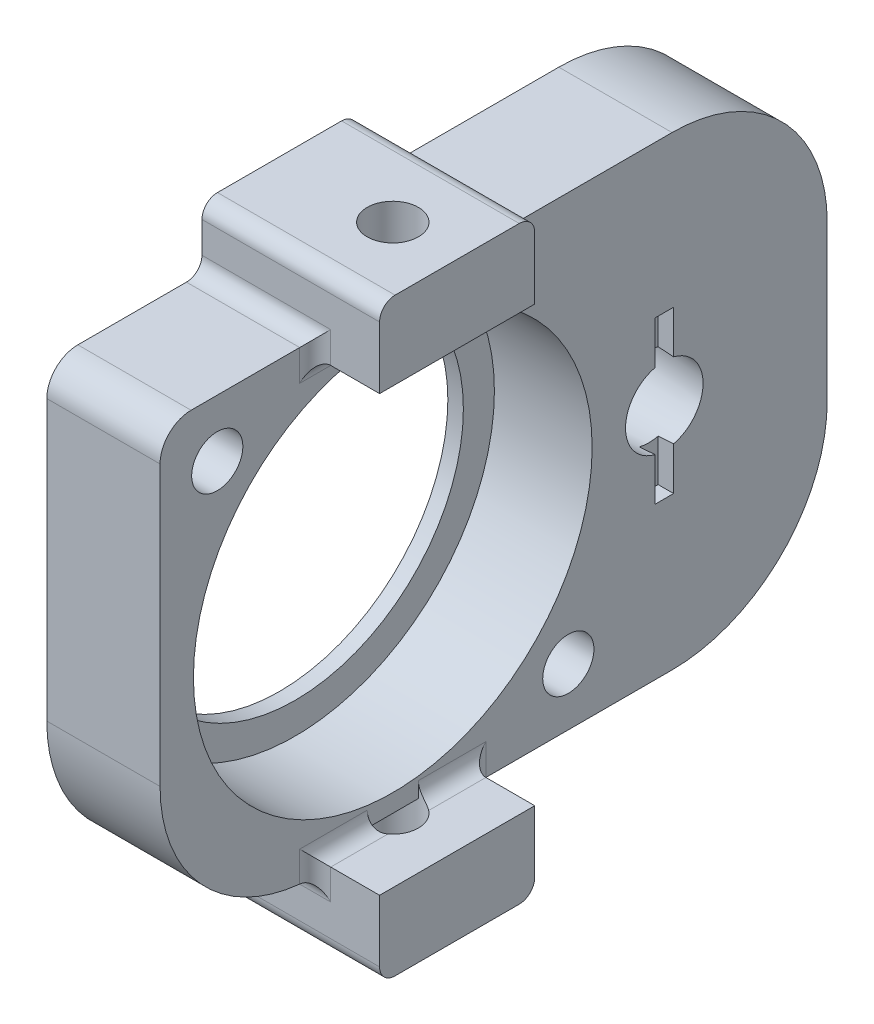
ISO-10303-21;
HEADER;
FILE_DESCRIPTION(('STEP AP214'),'2;1');
FILE_NAME('part.step','',(''),(''),'','','');
FILE_SCHEMA(('AUTOMOTIVE_DESIGN { 1 0 10303 214 1 1 1 1 }'));
ENDSEC;
DATA;
#1=APPLICATION_CONTEXT('core data for automotive mechanical design processes');
#2=APPLICATION_PROTOCOL_DEFINITION('international standard','automotive_design',2000,#1);
#3=PRODUCT_CONTEXT('',#1,'mechanical');
#4=PRODUCT('Part','Part','',(#3));
#5=PRODUCT_RELATED_PRODUCT_CATEGORY('part','',(#4));
#6=PRODUCT_DEFINITION_FORMATION('','',#4);
#7=PRODUCT_DEFINITION_CONTEXT('part definition',#1,'design');
#8=PRODUCT_DEFINITION('design','',#6,#7);
#9=PRODUCT_DEFINITION_SHAPE('','',#8);
#10=(LENGTH_UNIT() NAMED_UNIT(*) SI_UNIT(.MILLI.,.METRE.));
#11=(NAMED_UNIT(*) PLANE_ANGLE_UNIT() SI_UNIT($,.RADIAN.));
#12=(NAMED_UNIT(*) SI_UNIT($,.STERADIAN.) SOLID_ANGLE_UNIT());
#13=UNCERTAINTY_MEASURE_WITH_UNIT(LENGTH_MEASURE(1.E-05),#10,'distance_accuracy_value','');
#14=(GEOMETRIC_REPRESENTATION_CONTEXT(3) GLOBAL_UNCERTAINTY_ASSIGNED_CONTEXT((#13)) GLOBAL_UNIT_ASSIGNED_CONTEXT((#10,
#11,#12)) REPRESENTATION_CONTEXT('',''));
#15=CARTESIAN_POINT('',(0.,0.,0.));
#16=DIRECTION('',(0.,0.,1.));
#17=DIRECTION('',(1.,0.,0.));
#18=AXIS2_PLACEMENT_3D('',#15,#16,#17);
#19=CARTESIAN_POINT('',(1.,-11.3137084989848,-11.3137084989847));
#20=DIRECTION('',(-1.,0.,0.));
#21=DIRECTION('',(0.,0.,1.));
#22=AXIS2_PLACEMENT_3D('',#19,#20,#21);
#23=CYLINDRICAL_SURFACE('',#22,1.65);
#24=CARTESIAN_POINT('',(7.3,-11.3137084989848,-11.3137084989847));
#25=DIRECTION('',(1.,0.,0.));
#26=DIRECTION('',(0.,0.,-1.));
#27=AXIS2_PLACEMENT_3D('',#24,#25,#26);
#28=CIRCLE('',#27,1.65);
#29=CARTESIAN_POINT('',(7.3,-11.3137084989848,-12.9637084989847));
#30=VERTEX_POINT('',#29);
#31=EDGE_CURVE('E599',#30,#30,#28,.T.);
#32=ORIENTED_EDGE('',*,*,#31,.T.);
#33=EDGE_LOOP('',(#32));
#34=FACE_BOUND('',#33,.T.);
#35=CARTESIAN_POINT('',(3.6,-11.3137084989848,-11.3137084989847));
#36=DIRECTION('',(-1.,0.,0.));
#37=DIRECTION('',(0.,0.,1.));
#38=AXIS2_PLACEMENT_3D('',#35,#36,#37);
#39=CIRCLE('',#38,1.65);
#40=CARTESIAN_POINT('',(3.6,-11.3137084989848,-9.6637084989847));
#41=VERTEX_POINT('',#40);
#42=EDGE_CURVE('E526',#41,#41,#39,.T.);
#43=ORIENTED_EDGE('',*,*,#42,.T.);
#44=EDGE_LOOP('',(#43));
#45=FACE_BOUND('',#44,.T.);
#46=ADVANCED_FACE('F44',(#34,#45),#23,.F.);
#47=CARTESIAN_POINT('',(1.,11.3137084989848,11.3137084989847));
#48=DIRECTION('',(-1.,0.,0.));
#49=DIRECTION('',(0.,0.,1.));
#50=AXIS2_PLACEMENT_3D('',#47,#48,#49);
#51=CYLINDRICAL_SURFACE('',#50,1.65);
#52=CARTESIAN_POINT('',(7.3,11.3137084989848,11.3137084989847));
#53=DIRECTION('',(1.,0.,0.));
#54=DIRECTION('',(0.,0.,-1.));
#55=AXIS2_PLACEMENT_3D('',#52,#53,#54);
#56=CIRCLE('',#55,1.65);
#57=CARTESIAN_POINT('',(7.3,11.3137084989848,9.6637084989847));
#58=VERTEX_POINT('',#57);
#59=EDGE_CURVE('E578',#58,#58,#56,.T.);
#60=ORIENTED_EDGE('',*,*,#59,.T.);
#61=EDGE_LOOP('',(#60));
#62=FACE_BOUND('',#61,.T.);
#63=CARTESIAN_POINT('',(3.6,11.3137084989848,11.3137084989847));
#64=DIRECTION('',(-1.,0.,0.));
#65=DIRECTION('',(0.,0.,1.));
#66=AXIS2_PLACEMENT_3D('',#63,#64,#65);
#67=CIRCLE('',#66,1.65);
#68=CARTESIAN_POINT('',(3.6,11.3137084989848,12.9637084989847));
#69=VERTEX_POINT('',#68);
#70=EDGE_CURVE('E452',#69,#69,#67,.T.);
#71=ORIENTED_EDGE('',*,*,#70,.T.);
#72=EDGE_LOOP('',(#71));
#73=FACE_BOUND('',#72,.T.);
#74=ADVANCED_FACE('F898',(#62,#73),#51,.F.);
#75=CARTESIAN_POINT('',(1.,0.,0.));
#76=DIRECTION('',(1.,0.,0.));
#77=DIRECTION('',(0.,0.,-1.));
#78=AXIS2_PLACEMENT_3D('',#75,#76,#77);
#79=PLANE('',#78);
#80=CARTESIAN_POINT('',(1.,0.,0.));
#81=DIRECTION('',(1.,0.,0.));
#82=DIRECTION('',(0.,0.,-1.));
#83=AXIS2_PLACEMENT_3D('',#80,#81,#82);
#84=CIRCLE('',#83,10.85);
#85=CARTESIAN_POINT('',(1.,0.,-10.85));
#86=VERTEX_POINT('',#85);
#87=EDGE_CURVE('E626',#86,#86,#84,.T.);
#88=ORIENTED_EDGE('',*,*,#87,.F.);
#89=EDGE_LOOP('',(#88));
#90=FACE_BOUND('',#89,.T.);
#91=CARTESIAN_POINT('',(1.,0.,0.));
#92=DIRECTION('',(1.,0.,0.));
#93=DIRECTION('',(0.,0.,-1.));
#94=AXIS2_PLACEMENT_3D('',#91,#92,#93);
#95=CIRCLE('',#94,12.85);
#96=CARTESIAN_POINT('',(1.,0.,-12.85));
#97=VERTEX_POINT('',#96);
#98=EDGE_CURVE('E610',#97,#97,#95,.T.);
#99=ORIENTED_EDGE('',*,*,#98,.T.);
#100=EDGE_LOOP('',(#99));
#101=FACE_BOUND('',#100,.T.);
#102=ADVANCED_FACE('F905',(#90,#101),#79,.T.);
#103=CARTESIAN_POINT('',(0.,0.,0.));
#104=DIRECTION('',(1.,0.,0.));
#105=DIRECTION('',(0.,0.,-1.));
#106=AXIS2_PLACEMENT_3D('',#103,#104,#105);
#107=PLANE('',#106);
#108=CARTESIAN_POINT('',(0.,0.,-17.5));
#109=DIRECTION('',(1.,0.,0.));
#110=DIRECTION('',(0.,0.,-1.));
#111=AXIS2_PLACEMENT_3D('',#108,#109,#110);
#112=CIRCLE('',#111,3.00000000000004);
#113=CARTESIAN_POINT('',(0.,0.,-20.5));
#114=VERTEX_POINT('',#113);
#115=EDGE_CURVE('E1046',#114,#114,#112,.T.);
#116=ORIENTED_EDGE('',*,*,#115,.T.);
#117=EDGE_LOOP('',(#116));
#118=FACE_BOUND('',#117,.T.);
#119=DIRECTION('',(0.,0.258819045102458,0.965925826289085));
#120=VECTOR('',#119,1.);
#121=CARTESIAN_POINT('',(0.,8.1349465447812,10.4619618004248));
#122=LINE('',#121,#120);
#123=CARTESIAN_POINT('',(0.,8.1349465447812,10.4619618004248));
#124=VERTEX_POINT('',#123);
#125=CARTESIAN_POINT('',(0.,8.98669324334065,13.6407237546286));
#126=VERTEX_POINT('',#125);
#127=EDGE_CURVE('E439',#124,#126,#122,.T.);
#128=ORIENTED_EDGE('',*,*,#127,.F.);
#129=DIRECTION('',(0.,-0.707106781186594,0.707106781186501));
#130=VECTOR('',#129,1.);
#131=CARTESIAN_POINT('',(0.,10.4619618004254,8.13494654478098));
#132=LINE('',#131,#130);
#133=CARTESIAN_POINT('',(0.,10.4619618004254,8.13494654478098));
#134=VERTEX_POINT('',#133);
#135=EDGE_CURVE('E407',#134,#124,#132,.T.);
#136=ORIENTED_EDGE('',*,*,#135,.F.);
#137=DIRECTION('',(0.,-0.965925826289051,-0.258819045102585));
#138=VECTOR('',#137,1.);
#139=CARTESIAN_POINT('',(0.,13.640723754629,8.98669324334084));
#140=LINE('',#139,#138);
#141=CARTESIAN_POINT('',(0.,13.640723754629,8.98669324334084));
#142=VERTEX_POINT('',#141);
#143=EDGE_CURVE('E425',#142,#134,#140,.T.);
#144=ORIENTED_EDGE('',*,*,#143,.F.);
#145=DIRECTION('',(0.,-0.258819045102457,-0.965925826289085));
#146=VECTOR('',#145,1.);
#147=CARTESIAN_POINT('',(0.,14.4924704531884,12.1654551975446));
#148=LINE('',#147,#146);
#149=CARTESIAN_POINT('',(0.,14.4924704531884,12.1654551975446));
#150=VERTEX_POINT('',#149);
#151=EDGE_CURVE('E428',#150,#142,#148,.T.);
#152=ORIENTED_EDGE('',*,*,#151,.F.);
#153=DIRECTION('',(0.,0.707106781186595,-0.7071067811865));
#154=VECTOR('',#153,1.);
#155=CARTESIAN_POINT('',(0.,12.1654551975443,14.4924704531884));
#156=LINE('',#155,#154);
#157=CARTESIAN_POINT('',(0.,12.1654551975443,14.4924704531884));
#158=VERTEX_POINT('',#157);
#159=EDGE_CURVE('E445',#158,#150,#156,.T.);
#160=ORIENTED_EDGE('',*,*,#159,.F.);
#161=DIRECTION('',(0.,0.965925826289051,0.258819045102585));
#162=VECTOR('',#161,1.);
#163=CARTESIAN_POINT('',(0.,8.98669324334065,13.6407237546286));
#164=LINE('',#163,#162);
#165=EDGE_CURVE('E442',#126,#158,#164,.T.);
#166=ORIENTED_EDGE('',*,*,#165,.F.);
#167=EDGE_LOOP('',(#128,#136,#144,#152,#160,#166));
#168=FACE_BOUND('',#167,.T.);
#169=DIRECTION('',(0.,-0.707106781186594,0.707106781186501));
#170=VECTOR('',#169,1.);
#171=CARTESIAN_POINT('',(0.,-12.1654551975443,-14.4924704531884));
#172=LINE('',#171,#170);
#173=CARTESIAN_POINT('',(0.,-12.1654551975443,-14.4924704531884));
#174=VERTEX_POINT('',#173);
#175=CARTESIAN_POINT('',(0.,-14.4924704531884,-12.1654551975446));
#176=VERTEX_POINT('',#175);
#177=EDGE_CURVE('E488',#174,#176,#172,.T.);
#178=ORIENTED_EDGE('',*,*,#177,.F.);
#179=DIRECTION('',(0.,-0.965925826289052,-0.258819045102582));
#180=VECTOR('',#179,1.);
#181=CARTESIAN_POINT('',(0.,-8.98669324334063,-13.6407237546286));
#182=LINE('',#181,#180);
#183=CARTESIAN_POINT('',(0.,-8.98669324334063,-13.6407237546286));
#184=VERTEX_POINT('',#183);
#185=EDGE_CURVE('E440',#184,#174,#182,.T.);
#186=ORIENTED_EDGE('',*,*,#185,.F.);
#187=DIRECTION('',(0.,-0.258819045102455,-0.965925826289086));
#188=VECTOR('',#187,1.);
#189=CARTESIAN_POINT('',(0.,-8.1349465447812,-10.4619618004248));
#190=LINE('',#189,#188);
#191=CARTESIAN_POINT('',(0.,-8.1349465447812,-10.4619618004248));
#192=VERTEX_POINT('',#191);
#193=EDGE_CURVE('E475',#192,#184,#190,.T.);
#194=ORIENTED_EDGE('',*,*,#193,.F.);
#195=DIRECTION('',(0.,0.707106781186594,-0.707106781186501));
#196=VECTOR('',#195,1.);
#197=CARTESIAN_POINT('',(0.,-10.4619618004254,-8.13494654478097));
#198=LINE('',#197,#196);
#199=CARTESIAN_POINT('',(0.,-10.4619618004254,-8.13494654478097));
#200=VERTEX_POINT('',#199);
#201=EDGE_CURVE('E478',#200,#192,#198,.T.);
#202=ORIENTED_EDGE('',*,*,#201,.F.);
#203=DIRECTION('',(0.,0.965925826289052,0.25881904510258));
#204=VECTOR('',#203,1.);
#205=CARTESIAN_POINT('',(0.,-13.640723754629,-8.98669324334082));
#206=LINE('',#205,#204);
#207=CARTESIAN_POINT('',(0.,-13.640723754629,-8.98669324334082));
#208=VERTEX_POINT('',#207);
#209=EDGE_CURVE('E482',#208,#200,#206,.T.);
#210=ORIENTED_EDGE('',*,*,#209,.F.);
#211=DIRECTION('',(0.,0.258819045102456,0.965925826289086));
#212=VECTOR('',#211,1.);
#213=CARTESIAN_POINT('',(0.,-14.4924704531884,-12.1654551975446));
#214=LINE('',#213,#212);
#215=EDGE_CURVE('E485',#176,#208,#214,.T.);
#216=ORIENTED_EDGE('',*,*,#215,.F.);
#217=EDGE_LOOP('',(#178,#186,#194,#202,#210,#216));
#218=FACE_BOUND('',#217,.T.);
#219=DIRECTION('',(0.,-1.,0.));
#220=VECTOR('',#219,1.);
#221=CARTESIAN_POINT('',(0.,-15.,15.));
#222=LINE('',#221,#220);
#223=CARTESIAN_POINT('',(0.,13.,15.));
#224=VERTEX_POINT('',#223);
#225=CARTESIAN_POINT('',(0.,-5.,15.));
#226=VERTEX_POINT('',#225);
#227=EDGE_CURVE('E629',#224,#226,#222,.T.);
#228=ORIENTED_EDGE('',*,*,#227,.F.);
#229=CARTESIAN_POINT('',(0.,13.,13.));
#230=DIRECTION('',(1.,0.,0.));
#231=DIRECTION('',(0.,0.,-1.));
#232=AXIS2_PLACEMENT_3D('',#229,#230,#231);
#233=CIRCLE('',#232,2.);
#234=CARTESIAN_POINT('',(0.,15.,13.));
#235=VERTEX_POINT('',#234);
#236=EDGE_CURVE('E1040',#224,#235,#233,.F.);
#237=ORIENTED_EDGE('',*,*,#236,.T.);
#238=DIRECTION('',(0.,0.,1.));
#239=VECTOR('',#238,1.);
#240=CARTESIAN_POINT('',(0.,15.,5.));
#241=LINE('',#240,#239);
#242=CARTESIAN_POINT('',(0.,15.,6.));
#243=VERTEX_POINT('',#242);
#244=EDGE_CURVE('E659',#243,#235,#241,.T.);
#245=ORIENTED_EDGE('',*,*,#244,.F.);
#246=CARTESIAN_POINT('',(0.,16.,6.));
#247=DIRECTION('',(1.,0.,0.));
#248=DIRECTION('',(0.,0.,-1.));
#249=AXIS2_PLACEMENT_3D('',#246,#247,#248);
#250=CIRCLE('',#249,1.);
#251=CARTESIAN_POINT('',(0.,16.,5.));
#252=VERTEX_POINT('',#251);
#253=EDGE_CURVE('E1008',#243,#252,#250,.T.);
#254=ORIENTED_EDGE('',*,*,#253,.T.);
#255=DIRECTION('',(0.,-1.,0.));
#256=VECTOR('',#255,1.);
#257=CARTESIAN_POINT('',(0.,15.,5.));
#258=LINE('',#257,#256);
#259=CARTESIAN_POINT('',(0.,18.,5.));
#260=VERTEX_POINT('',#259);
#261=EDGE_CURVE('E656',#260,#252,#258,.T.);
#262=ORIENTED_EDGE('',*,*,#261,.F.);
#263=CARTESIAN_POINT('',(0.,18.,4.));
#264=DIRECTION('',(1.,0.,0.));
#265=DIRECTION('',(0.,0.,-1.));
#266=AXIS2_PLACEMENT_3D('',#263,#264,#265);
#267=CIRCLE('',#266,1.);
#268=CARTESIAN_POINT('',(0.,19.,4.));
#269=VERTEX_POINT('',#268);
#270=EDGE_CURVE('E775',#260,#269,#267,.F.);
#271=ORIENTED_EDGE('',*,*,#270,.T.);
#272=DIRECTION('',(0.,0.,1.));
#273=VECTOR('',#272,1.);
#274=CARTESIAN_POINT('',(0.,19.,5.));
#275=LINE('',#274,#273);
#276=CARTESIAN_POINT('',(0.,19.,-4.));
#277=VERTEX_POINT('',#276);
#278=EDGE_CURVE('E653',#277,#269,#275,.T.);
#279=ORIENTED_EDGE('',*,*,#278,.F.);
#280=CARTESIAN_POINT('',(0.,18.,-4.));
#281=DIRECTION('',(1.,0.,0.));
#282=DIRECTION('',(0.,0.,-1.));
#283=AXIS2_PLACEMENT_3D('',#280,#281,#282);
#284=CIRCLE('',#283,1.);
#285=CARTESIAN_POINT('',(0.,18.,-5.));
#286=VERTEX_POINT('',#285);
#287=EDGE_CURVE('E773',#277,#286,#284,.F.);
#288=ORIENTED_EDGE('',*,*,#287,.T.);
#289=DIRECTION('',(0.,1.,0.));
#290=VECTOR('',#289,1.);
#291=CARTESIAN_POINT('',(0.,19.,-5.));
#292=LINE('',#291,#290);
#293=CARTESIAN_POINT('',(0.,16.,-5.));
#294=VERTEX_POINT('',#293);
#295=EDGE_CURVE('E650',#294,#286,#292,.T.);
#296=ORIENTED_EDGE('',*,*,#295,.F.);
#297=CARTESIAN_POINT('',(0.,16.,-6.));
#298=DIRECTION('',(1.,0.,0.));
#299=DIRECTION('',(0.,0.,-1.));
#300=AXIS2_PLACEMENT_3D('',#297,#298,#299);
#301=CIRCLE('',#300,1.);
#302=CARTESIAN_POINT('',(0.,15.,-6.));
#303=VERTEX_POINT('',#302);
#304=EDGE_CURVE('E1007',#294,#303,#301,.T.);
#305=ORIENTED_EDGE('',*,*,#304,.T.);
#306=DIRECTION('',(0.,0.,1.));
#307=VECTOR('',#306,1.);
#308=CARTESIAN_POINT('',(0.,15.,-28.));
#309=LINE('',#308,#307);
#310=CARTESIAN_POINT('',(0.,15.,-18.));
#311=VERTEX_POINT('',#310);
#312=EDGE_CURVE('E647',#311,#303,#309,.T.);
#313=ORIENTED_EDGE('',*,*,#312,.F.);
#314=CARTESIAN_POINT('',(0.,5.,-18.));
#315=DIRECTION('',(1.,0.,0.));
#316=DIRECTION('',(0.,0.,-1.));
#317=AXIS2_PLACEMENT_3D('',#314,#315,#316);
#318=CIRCLE('',#317,10.);
#319=CARTESIAN_POINT('',(0.,4.99999999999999,-28.));
#320=VERTEX_POINT('',#319);
#321=EDGE_CURVE('E679',#311,#320,#318,.F.);
#322=ORIENTED_EDGE('',*,*,#321,.T.);
#323=DIRECTION('',(0.,1.,0.));
#324=VECTOR('',#323,1.);
#325=CARTESIAN_POINT('',(0.,-15.,-28.));
#326=LINE('',#325,#324);
#327=CARTESIAN_POINT('',(0.,-5.,-28.));
#328=VERTEX_POINT('',#327);
#329=EDGE_CURVE('E644',#328,#320,#326,.T.);
#330=ORIENTED_EDGE('',*,*,#329,.F.);
#331=CARTESIAN_POINT('',(0.,-5.,-18.));
#332=DIRECTION('',(1.,0.,0.));
#333=DIRECTION('',(0.,0.,-1.));
#334=AXIS2_PLACEMENT_3D('',#331,#332,#333);
#335=CIRCLE('',#334,10.);
#336=CARTESIAN_POINT('',(0.,-15.,-18.));
#337=VERTEX_POINT('',#336);
#338=EDGE_CURVE('E676',#328,#337,#335,.F.);
#339=ORIENTED_EDGE('',*,*,#338,.T.);
#340=DIRECTION('',(0.,0.,-1.));
#341=VECTOR('',#340,1.);
#342=CARTESIAN_POINT('',(0.,-15.,-5.));
#343=LINE('',#342,#341);
#344=CARTESIAN_POINT('',(0.,-15.,-6.));
#345=VERTEX_POINT('',#344);
#346=EDGE_CURVE('E642',#345,#337,#343,.T.);
#347=ORIENTED_EDGE('',*,*,#346,.F.);
#348=CARTESIAN_POINT('',(0.,-16.,-6.));
#349=DIRECTION('',(1.,0.,0.));
#350=DIRECTION('',(0.,0.,-1.));
#351=AXIS2_PLACEMENT_3D('',#348,#349,#350);
#352=CIRCLE('',#351,1.);
#353=CARTESIAN_POINT('',(0.,-16.,-5.));
#354=VERTEX_POINT('',#353);
#355=EDGE_CURVE('E1012',#345,#354,#352,.T.);
#356=ORIENTED_EDGE('',*,*,#355,.T.);
#357=DIRECTION('',(0.,1.,0.));
#358=VECTOR('',#357,1.);
#359=CARTESIAN_POINT('',(0.,-19.,-5.));
#360=LINE('',#359,#358);
#361=CARTESIAN_POINT('',(0.,-18.,-5.));
#362=VERTEX_POINT('',#361);
#363=EDGE_CURVE('E639',#362,#354,#360,.T.);
#364=ORIENTED_EDGE('',*,*,#363,.F.);
#365=CARTESIAN_POINT('',(0.,-18.,-4.));
#366=DIRECTION('',(1.,0.,0.));
#367=DIRECTION('',(0.,0.,-1.));
#368=AXIS2_PLACEMENT_3D('',#365,#366,#367);
#369=CIRCLE('',#368,1.);
#370=CARTESIAN_POINT('',(0.,-19.,-4.));
#371=VERTEX_POINT('',#370);
#372=EDGE_CURVE('E771',#362,#371,#369,.F.);
#373=ORIENTED_EDGE('',*,*,#372,.T.);
#374=DIRECTION('',(0.,0.,-1.));
#375=VECTOR('',#374,1.);
#376=CARTESIAN_POINT('',(0.,-19.,5.));
#377=LINE('',#376,#375);
#378=CARTESIAN_POINT('',(0.,-19.,4.));
#379=VERTEX_POINT('',#378);
#380=EDGE_CURVE('E636',#379,#371,#377,.T.);
#381=ORIENTED_EDGE('',*,*,#380,.F.);
#382=CARTESIAN_POINT('',(0.,-18.,4.));
#383=DIRECTION('',(1.,0.,0.));
#384=DIRECTION('',(0.,0.,-1.));
#385=AXIS2_PLACEMENT_3D('',#382,#383,#384);
#386=CIRCLE('',#385,1.);
#387=CARTESIAN_POINT('',(0.,-18.,5.));
#388=VERTEX_POINT('',#387);
#389=EDGE_CURVE('E769',#379,#388,#386,.F.);
#390=ORIENTED_EDGE('',*,*,#389,.T.);
#391=DIRECTION('',(0.,-1.,0.));
#392=VECTOR('',#391,1.);
#393=CARTESIAN_POINT('',(0.,-15.,5.));
#394=LINE('',#393,#392);
#395=CARTESIAN_POINT('',(0.,-15.9544511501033,5.));
#396=VERTEX_POINT('',#395);
#397=EDGE_CURVE('E633',#396,#388,#394,.T.);
#398=ORIENTED_EDGE('',*,*,#397,.F.);
#399=CARTESIAN_POINT('',(0.,-15.9544511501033,6.));
#400=DIRECTION('',(1.,0.,0.));
#401=DIRECTION('',(0.,0.,-1.));
#402=AXIS2_PLACEMENT_3D('',#399,#400,#401);
#403=CIRCLE('',#402,1.);
#404=CARTESIAN_POINT('',(0.,-14.9585919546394,5.90909090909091));
#405=VERTEX_POINT('',#404);
#406=EDGE_CURVE('E853',#396,#405,#403,.T.);
#407=ORIENTED_EDGE('',*,*,#406,.T.);
#408=CARTESIAN_POINT('',(0.,-5.,5.));
#409=DIRECTION('',(1.,0.,0.));
#410=DIRECTION('',(0.,0.,-1.));
#411=AXIS2_PLACEMENT_3D('',#408,#409,#410);
#412=CIRCLE('',#411,10.);
#413=EDGE_CURVE('E673',#405,#226,#412,.F.);
#414=ORIENTED_EDGE('',*,*,#413,.T.);
#415=EDGE_LOOP('',(#228,#237,#245,#254,#262,#271,#279,#288,#296,#305,#313,#322,#330,#339,#347,
#356,#364,#373,#381,#390,#398,#407,#414));
#416=FACE_BOUND('',#415,.T.);
#417=CARTESIAN_POINT('',(0.,0.,0.));
#418=DIRECTION('',(1.,0.,0.));
#419=DIRECTION('',(0.,0.,-1.));
#420=AXIS2_PLACEMENT_3D('',#417,#418,#419);
#421=CIRCLE('',#420,10.85);
#422=CARTESIAN_POINT('',(0.,0.,-10.85));
#423=VERTEX_POINT('',#422);
#424=EDGE_CURVE('E625',#423,#423,#421,.T.);
#425=ORIENTED_EDGE('',*,*,#424,.T.);
#426=EDGE_LOOP('',(#425));
#427=FACE_BOUND('',#426,.T.);
#428=ADVANCED_FACE('F919',(#118,#168,#218,#416,#427),#107,.F.);
#429=CARTESIAN_POINT('',(1.,-15.,15.));
#430=DIRECTION('',(0.,0.,-1.));
#431=DIRECTION('',(-1.,0.,0.));
#432=AXIS2_PLACEMENT_3D('',#429,#430,#431);
#433=PLANE('',#432);
#434=DIRECTION('',(0.,-1.,0.));
#435=VECTOR('',#434,1.);
#436=CARTESIAN_POINT('',(7.3,15.,15.));
#437=LINE('',#436,#435);
#438=CARTESIAN_POINT('',(7.3,13.,15.));
#439=VERTEX_POINT('',#438);
#440=CARTESIAN_POINT('',(7.3,-5.,15.));
#441=VERTEX_POINT('',#440);
#442=EDGE_CURVE('E623',#439,#441,#437,.T.);
#443=ORIENTED_EDGE('',*,*,#442,.F.);
#444=DIRECTION('',(-1.,0.,0.));
#445=VECTOR('',#444,1.);
#446=CARTESIAN_POINT('',(1.,13.,15.));
#447=LINE('',#446,#445);
#448=EDGE_CURVE('E1016',#439,#224,#447,.T.);
#449=ORIENTED_EDGE('',*,*,#448,.T.);
#450=ORIENTED_EDGE('',*,*,#227,.T.);
#451=DIRECTION('',(-1.,0.,0.));
#452=VECTOR('',#451,1.);
#453=CARTESIAN_POINT('',(1.,-5.,15.));
#454=LINE('',#453,#452);
#455=EDGE_CURVE('E696',#226,#441,#454,.F.);
#456=ORIENTED_EDGE('',*,*,#455,.T.);
#457=EDGE_LOOP('',(#443,#449,#450,#456));
#458=FACE_BOUND('',#457,.T.);
#459=ADVANCED_FACE('F922',(#458),#433,.F.);
#460=CARTESIAN_POINT('',(1.,-15.,5.));
#461=DIRECTION('',(0.,0.,-1.));
#462=DIRECTION('',(0.,1.,0.));
#463=AXIS2_PLACEMENT_3D('',#460,#461,#462);
#464=PLANE('',#463);
#465=DIRECTION('',(-1.,0.,0.));
#466=VECTOR('',#465,1.);
#467=CARTESIAN_POINT('',(11.45,-14.,5.));
#468=LINE('',#467,#466);
#469=CARTESIAN_POINT('',(11.45,-14.,5.));
#470=VERTEX_POINT('',#469);
#471=CARTESIAN_POINT('',(8.3,-14.,5.));
#472=VERTEX_POINT('',#471);
#473=EDGE_CURVE('E554',#470,#472,#468,.T.);
#474=ORIENTED_EDGE('',*,*,#473,.T.);
#475=DIRECTION('',(0.,-1.,0.));
#476=VECTOR('',#475,1.);
#477=CARTESIAN_POINT('',(8.3,-15.,5.));
#478=LINE('',#477,#476);
#479=CARTESIAN_POINT('',(8.3,-15.9544511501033,5.));
#480=VERTEX_POINT('',#479);
#481=EDGE_CURVE('E750',#472,#480,#478,.T.);
#482=ORIENTED_EDGE('',*,*,#481,.T.);
#483=DIRECTION('',(-1.,0.,0.));
#484=VECTOR('',#483,1.);
#485=CARTESIAN_POINT('',(1.,-15.9544511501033,5.));
#486=LINE('',#485,#484);
#487=EDGE_CURVE('E748',#480,#396,#486,.T.);
#488=ORIENTED_EDGE('',*,*,#487,.T.);
#489=ORIENTED_EDGE('',*,*,#397,.T.);
#490=DIRECTION('',(-1.,0.,0.));
#491=VECTOR('',#490,1.);
#492=CARTESIAN_POINT('',(1.,-18.,5.));
#493=LINE('',#492,#491);
#494=CARTESIAN_POINT('',(11.45,-18.,5.));
#495=VERTEX_POINT('',#494);
#496=EDGE_CURVE('E746',#388,#495,#493,.F.);
#497=ORIENTED_EDGE('',*,*,#496,.T.);
#498=DIRECTION('',(0.,-1.,0.));
#499=VECTOR('',#498,1.);
#500=CARTESIAN_POINT('',(11.45,-19.,5.));
#501=LINE('',#500,#499);
#502=EDGE_CURVE('E592',#470,#495,#501,.T.);
#503=ORIENTED_EDGE('',*,*,#502,.F.);
#504=EDGE_LOOP('',(#474,#482,#488,#489,#497,#503));
#505=FACE_BOUND('',#504,.T.);
#506=ADVANCED_FACE('F957',(#505),#464,.F.);
#507=CARTESIAN_POINT('',(1.,-19.,5.));
#508=DIRECTION('',(0.,1.,0.));
#509=DIRECTION('',(0.,0.,1.));
#510=AXIS2_PLACEMENT_3D('',#507,#508,#509);
#511=PLANE('',#510);
#512=CARTESIAN_POINT('',(7.3,-19.,0.));
#513=DIRECTION('',(0.,-1.,0.));
#514=DIRECTION('',(0.,0.,-1.));
#515=AXIS2_PLACEMENT_3D('',#512,#513,#514);
#516=CIRCLE('',#515,1.65);
#517=CARTESIAN_POINT('',(7.3,-19.,-1.65));
#518=VERTEX_POINT('',#517);
#519=EDGE_CURVE('E547',#518,#518,#516,.T.);
#520=ORIENTED_EDGE('',*,*,#519,.F.);
#521=EDGE_LOOP('',(#520));
#522=FACE_BOUND('',#521,.T.);
#523=ORIENTED_EDGE('',*,*,#380,.T.);
#524=DIRECTION('',(-1.,0.,0.));
#525=VECTOR('',#524,1.);
#526=CARTESIAN_POINT('',(1.,-19.,-4.));
#527=LINE('',#526,#525);
#528=CARTESIAN_POINT('',(11.45,-19.,-4.));
#529=VERTEX_POINT('',#528);
#530=EDGE_CURVE('E793',#371,#529,#527,.F.);
#531=ORIENTED_EDGE('',*,*,#530,.T.);
#532=DIRECTION('',(0.,0.,-1.));
#533=VECTOR('',#532,1.);
#534=CARTESIAN_POINT('',(11.45,-19.,-5.));
#535=LINE('',#534,#533);
#536=CARTESIAN_POINT('',(11.45,-19.,4.));
#537=VERTEX_POINT('',#536);
#538=EDGE_CURVE('E589',#537,#529,#535,.T.);
#539=ORIENTED_EDGE('',*,*,#538,.F.);
#540=DIRECTION('',(-1.,0.,0.));
#541=VECTOR('',#540,1.);
#542=CARTESIAN_POINT('',(1.,-19.,4.));
#543=LINE('',#542,#541);
#544=EDGE_CURVE('E790',#537,#379,#543,.T.);
#545=ORIENTED_EDGE('',*,*,#544,.T.);
#546=EDGE_LOOP('',(#523,#531,#539,#545));
#547=FACE_BOUND('',#546,.T.);
#548=ADVANCED_FACE('F953',(#522,#547),#511,.F.);
#549=CARTESIAN_POINT('',(1.,-19.,-5.));
#550=DIRECTION('',(0.,0.,1.));
#551=DIRECTION('',(0.,-1.,0.));
#552=AXIS2_PLACEMENT_3D('',#549,#550,#551);
#553=PLANE('',#552);
#554=DIRECTION('',(-1.,0.,0.));
#555=VECTOR('',#554,1.);
#556=CARTESIAN_POINT('',(7.3,-16.,-5.));
#557=LINE('',#556,#555);
#558=CARTESIAN_POINT('',(8.3,-16.,-5.));
#559=VERTEX_POINT('',#558);
#560=EDGE_CURVE('E761',#354,#559,#557,.F.);
#561=ORIENTED_EDGE('',*,*,#560,.T.);
#562=DIRECTION('',(0.,1.,0.));
#563=VECTOR('',#562,1.);
#564=CARTESIAN_POINT('',(8.3,-19.,-5.));
#565=LINE('',#564,#563);
#566=CARTESIAN_POINT('',(8.3,-14.,-5.));
#567=VERTEX_POINT('',#566);
#568=EDGE_CURVE('E763',#559,#567,#565,.T.);
#569=ORIENTED_EDGE('',*,*,#568,.T.);
#570=DIRECTION('',(-1.,0.,0.));
#571=VECTOR('',#570,1.);
#572=CARTESIAN_POINT('',(11.45,-14.,-5.));
#573=LINE('',#572,#571);
#574=CARTESIAN_POINT('',(11.45,-14.,-5.));
#575=VERTEX_POINT('',#574);
#576=EDGE_CURVE('E581',#575,#567,#573,.T.);
#577=ORIENTED_EDGE('',*,*,#576,.F.);
#578=DIRECTION('',(0.,1.,0.));
#579=VECTOR('',#578,1.);
#580=CARTESIAN_POINT('',(11.45,-14.,-5.));
#581=LINE('',#580,#579);
#582=CARTESIAN_POINT('',(11.45,-18.,-5.));
#583=VERTEX_POINT('',#582);
#584=EDGE_CURVE('E584',#583,#575,#581,.T.);
#585=ORIENTED_EDGE('',*,*,#584,.F.);
#586=DIRECTION('',(-1.,0.,0.));
#587=VECTOR('',#586,1.);
#588=CARTESIAN_POINT('',(1.,-18.,-5.));
#589=LINE('',#588,#587);
#590=EDGE_CURVE('E758',#583,#362,#589,.T.);
#591=ORIENTED_EDGE('',*,*,#590,.T.);
#592=ORIENTED_EDGE('',*,*,#363,.T.);
#593=EDGE_LOOP('',(#561,#569,#577,#585,#591,#592));
#594=FACE_BOUND('',#593,.T.);
#595=ADVANCED_FACE('F949',(#594),#553,.F.);
#596=CARTESIAN_POINT('',(1.,-15.,-5.));
#597=DIRECTION('',(0.,1.,0.));
#598=DIRECTION('',(0.,0.,1.));
#599=AXIS2_PLACEMENT_3D('',#596,#597,#598);
#600=PLANE('',#599);
#601=DIRECTION('',(0.,0.,-1.));
#602=VECTOR('',#601,1.);
#603=CARTESIAN_POINT('',(7.3,-15.,-5.));
#604=LINE('',#603,#602);
#605=CARTESIAN_POINT('',(7.3,-15.,-6.));
#606=VERTEX_POINT('',#605);
#607=CARTESIAN_POINT('',(7.3,-15.,-18.));
#608=VERTEX_POINT('',#607);
#609=EDGE_CURVE('E609',#606,#608,#604,.T.);
#610=ORIENTED_EDGE('',*,*,#609,.F.);
#611=DIRECTION('',(-1.,0.,0.));
#612=VECTOR('',#611,1.);
#613=CARTESIAN_POINT('',(0.,-15.,-6.));
#614=LINE('',#613,#612);
#615=EDGE_CURVE('E788',#606,#345,#614,.T.);
#616=ORIENTED_EDGE('',*,*,#615,.T.);
#617=ORIENTED_EDGE('',*,*,#346,.T.);
#618=DIRECTION('',(-1.,0.,0.));
#619=VECTOR('',#618,1.);
#620=CARTESIAN_POINT('',(1.,-15.,-18.));
#621=LINE('',#620,#619);
#622=EDGE_CURVE('E693',#337,#608,#621,.F.);
#623=ORIENTED_EDGE('',*,*,#622,.T.);
#624=EDGE_LOOP('',(#610,#616,#617,#623));
#625=FACE_BOUND('',#624,.T.);
#626=ADVANCED_FACE('F945',(#625),#600,.F.);
#627=CARTESIAN_POINT('',(1.,-15.,-28.));
#628=DIRECTION('',(0.,0.,1.));
#629=DIRECTION('',(1.,0.,0.));
#630=AXIS2_PLACEMENT_3D('',#627,#628,#629);
#631=PLANE('',#630);
#632=ORIENTED_EDGE('',*,*,#329,.T.);
#633=DIRECTION('',(-1.,0.,0.));
#634=VECTOR('',#633,1.);
#635=CARTESIAN_POINT('',(1.,5.,-28.));
#636=LINE('',#635,#634);
#637=CARTESIAN_POINT('',(7.3,4.99999999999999,-28.));
#638=VERTEX_POINT('',#637);
#639=EDGE_CURVE('E684',#320,#638,#636,.F.);
#640=ORIENTED_EDGE('',*,*,#639,.T.);
#641=DIRECTION('',(0.,1.,0.));
#642=VECTOR('',#641,1.);
#643=CARTESIAN_POINT('',(7.3,-15.,-28.));
#644=LINE('',#643,#642);
#645=CARTESIAN_POINT('',(7.3,-5.,-28.));
#646=VERTEX_POINT('',#645);
#647=EDGE_CURVE('E614',#646,#638,#644,.T.);
#648=ORIENTED_EDGE('',*,*,#647,.F.);
#649=DIRECTION('',(-1.,0.,0.));
#650=VECTOR('',#649,1.);
#651=CARTESIAN_POINT('',(1.,-5.,-28.));
#652=LINE('',#651,#650);
#653=EDGE_CURVE('E681',#646,#328,#652,.T.);
#654=ORIENTED_EDGE('',*,*,#653,.T.);
#655=EDGE_LOOP('',(#632,#640,#648,#654));
#656=FACE_BOUND('',#655,.T.);
#657=ADVANCED_FACE('F941',(#656),#631,.F.);
#658=CARTESIAN_POINT('',(1.,15.,-28.));
#659=DIRECTION('',(0.,-1.,0.));
#660=DIRECTION('',(0.,0.,-1.));
#661=AXIS2_PLACEMENT_3D('',#658,#659,#660);
#662=PLANE('',#661);
#663=ORIENTED_EDGE('',*,*,#312,.T.);
#664=DIRECTION('',(-1.,0.,0.));
#665=VECTOR('',#664,1.);
#666=CARTESIAN_POINT('',(7.3,15.,-6.));
#667=LINE('',#666,#665);
#668=CARTESIAN_POINT('',(7.3,15.,-6.));
#669=VERTEX_POINT('',#668);
#670=EDGE_CURVE('E767',#303,#669,#667,.F.);
#671=ORIENTED_EDGE('',*,*,#670,.T.);
#672=DIRECTION('',(0.,0.,1.));
#673=VECTOR('',#672,1.);
#674=CARTESIAN_POINT('',(7.3,15.,-5.));
#675=LINE('',#674,#673);
#676=CARTESIAN_POINT('',(7.3,15.,-18.));
#677=VERTEX_POINT('',#676);
#678=EDGE_CURVE('E617',#677,#669,#675,.T.);
#679=ORIENTED_EDGE('',*,*,#678,.F.);
#680=DIRECTION('',(-1.,0.,0.));
#681=VECTOR('',#680,1.);
#682=CARTESIAN_POINT('',(1.,15.,-18.));
#683=LINE('',#682,#681);
#684=EDGE_CURVE('E666',#677,#311,#683,.T.);
#685=ORIENTED_EDGE('',*,*,#684,.T.);
#686=EDGE_LOOP('',(#663,#671,#679,#685));
#687=FACE_BOUND('',#686,.T.);
#688=ADVANCED_FACE('F937',(#687),#662,.F.);
#689=CARTESIAN_POINT('',(1.,19.,-5.));
#690=DIRECTION('',(0.,0.,1.));
#691=DIRECTION('',(0.,-1.,0.));
#692=AXIS2_PLACEMENT_3D('',#689,#690,#691);
#693=PLANE('',#692);
#694=DIRECTION('',(-1.,0.,0.));
#695=VECTOR('',#694,1.);
#696=CARTESIAN_POINT('',(11.45,14.,-5.));
#697=LINE('',#696,#695);
#698=CARTESIAN_POINT('',(11.45,14.,-5.));
#699=VERTEX_POINT('',#698);
#700=CARTESIAN_POINT('',(8.3,14.,-5.));
#701=VERTEX_POINT('',#700);
#702=EDGE_CURVE('E569',#699,#701,#697,.T.);
#703=ORIENTED_EDGE('',*,*,#702,.T.);
#704=DIRECTION('',(0.,1.,0.));
#705=VECTOR('',#704,1.);
#706=CARTESIAN_POINT('',(8.3,19.,-5.));
#707=LINE('',#706,#705);
#708=CARTESIAN_POINT('',(8.3,16.,-5.));
#709=VERTEX_POINT('',#708);
#710=EDGE_CURVE('E703',#701,#709,#707,.T.);
#711=ORIENTED_EDGE('',*,*,#710,.T.);
#712=DIRECTION('',(-1.,0.,0.));
#713=VECTOR('',#712,1.);
#714=CARTESIAN_POINT('',(0.,16.,-5.));
#715=LINE('',#714,#713);
#716=EDGE_CURVE('E701',#709,#294,#715,.T.);
#717=ORIENTED_EDGE('',*,*,#716,.T.);
#718=ORIENTED_EDGE('',*,*,#295,.T.);
#719=DIRECTION('',(-1.,0.,0.));
#720=VECTOR('',#719,1.);
#721=CARTESIAN_POINT('',(1.,18.,-5.));
#722=LINE('',#721,#720);
#723=CARTESIAN_POINT('',(11.45,18.,-5.));
#724=VERTEX_POINT('',#723);
#725=EDGE_CURVE('E699',#286,#724,#722,.F.);
#726=ORIENTED_EDGE('',*,*,#725,.T.);
#727=DIRECTION('',(0.,1.,0.));
#728=VECTOR('',#727,1.);
#729=CARTESIAN_POINT('',(11.45,14.,-5.));
#730=LINE('',#729,#728);
#731=EDGE_CURVE('E558',#699,#724,#730,.T.);
#732=ORIENTED_EDGE('',*,*,#731,.F.);
#733=EDGE_LOOP('',(#703,#711,#717,#718,#726,#732));
#734=FACE_BOUND('',#733,.T.);
#735=ADVANCED_FACE('F933',(#734),#693,.F.);
#736=CARTESIAN_POINT('',(1.,19.,5.));
#737=DIRECTION('',(0.,-1.,0.));
#738=DIRECTION('',(0.,0.,-1.));
#739=AXIS2_PLACEMENT_3D('',#736,#737,#738);
#740=PLANE('',#739);
#741=CARTESIAN_POINT('',(7.3,19.,0.));
#742=DIRECTION('',(0.,-1.,0.));
#743=DIRECTION('',(0.,0.,-1.));
#744=AXIS2_PLACEMENT_3D('',#741,#742,#743);
#745=CIRCLE('',#744,1.65);
#746=CARTESIAN_POINT('',(7.3,19.,-1.65));
#747=VERTEX_POINT('',#746);
#748=EDGE_CURVE('E536',#747,#747,#745,.T.);
#749=ORIENTED_EDGE('',*,*,#748,.T.);
#750=EDGE_LOOP('',(#749));
#751=FACE_BOUND('',#750,.T.);
#752=ORIENTED_EDGE('',*,*,#278,.T.);
#753=DIRECTION('',(-1.,0.,0.));
#754=VECTOR('',#753,1.);
#755=CARTESIAN_POINT('',(1.,19.,4.));
#756=LINE('',#755,#754);
#757=CARTESIAN_POINT('',(11.45,19.,4.));
#758=VERTEX_POINT('',#757);
#759=EDGE_CURVE('E780',#269,#758,#756,.F.);
#760=ORIENTED_EDGE('',*,*,#759,.T.);
#761=DIRECTION('',(0.,0.,1.));
#762=VECTOR('',#761,1.);
#763=CARTESIAN_POINT('',(11.45,19.,-5.));
#764=LINE('',#763,#762);
#765=CARTESIAN_POINT('',(11.45,19.,-4.));
#766=VERTEX_POINT('',#765);
#767=EDGE_CURVE('E561',#766,#758,#764,.T.);
#768=ORIENTED_EDGE('',*,*,#767,.F.);
#769=DIRECTION('',(-1.,0.,0.));
#770=VECTOR('',#769,1.);
#771=CARTESIAN_POINT('',(1.,19.,-4.));
#772=LINE('',#771,#770);
#773=EDGE_CURVE('E777',#766,#277,#772,.T.);
#774=ORIENTED_EDGE('',*,*,#773,.T.);
#775=EDGE_LOOP('',(#752,#760,#768,#774));
#776=FACE_BOUND('',#775,.T.);
#777=ADVANCED_FACE('F929',(#751,#776),#740,.F.);
#778=CARTESIAN_POINT('',(1.,15.,5.));
#779=DIRECTION('',(0.,0.,-1.));
#780=DIRECTION('',(0.,1.,0.));
#781=AXIS2_PLACEMENT_3D('',#778,#779,#780);
#782=PLANE('',#781);
#783=DIRECTION('',(0.,-1.,0.));
#784=VECTOR('',#783,1.);
#785=CARTESIAN_POINT('',(11.45,19.,5.));
#786=LINE('',#785,#784);
#787=CARTESIAN_POINT('',(11.45,18.,5.));
#788=VERTEX_POINT('',#787);
#789=CARTESIAN_POINT('',(11.45,14.,5.));
#790=VERTEX_POINT('',#789);
#791=EDGE_CURVE('E565',#788,#790,#786,.T.);
#792=ORIENTED_EDGE('',*,*,#791,.F.);
#793=DIRECTION('',(-1.,0.,0.));
#794=VECTOR('',#793,1.);
#795=CARTESIAN_POINT('',(1.,18.,5.));
#796=LINE('',#795,#794);
#797=EDGE_CURVE('E743',#788,#260,#796,.T.);
#798=ORIENTED_EDGE('',*,*,#797,.T.);
#799=ORIENTED_EDGE('',*,*,#261,.T.);
#800=DIRECTION('',(-1.,0.,0.));
#801=VECTOR('',#800,1.);
#802=CARTESIAN_POINT('',(7.3,16.,5.));
#803=LINE('',#802,#801);
#804=CARTESIAN_POINT('',(8.3,16.,5.));
#805=VERTEX_POINT('',#804);
#806=EDGE_CURVE('E739',#252,#805,#803,.F.);
#807=ORIENTED_EDGE('',*,*,#806,.T.);
#808=DIRECTION('',(0.,-1.,0.));
#809=VECTOR('',#808,1.);
#810=CARTESIAN_POINT('',(8.3,15.,5.));
#811=LINE('',#810,#809);
#812=CARTESIAN_POINT('',(8.3,14.,5.));
#813=VERTEX_POINT('',#812);
#814=EDGE_CURVE('E741',#805,#813,#811,.T.);
#815=ORIENTED_EDGE('',*,*,#814,.T.);
#816=DIRECTION('',(-1.,0.,0.));
#817=VECTOR('',#816,1.);
#818=CARTESIAN_POINT('',(11.45,14.,5.));
#819=LINE('',#818,#817);
#820=EDGE_CURVE('E575',#790,#813,#819,.T.);
#821=ORIENTED_EDGE('',*,*,#820,.F.);
#822=EDGE_LOOP('',(#792,#798,#799,#807,#815,#821));
#823=FACE_BOUND('',#822,.T.);
#824=ADVANCED_FACE('F925',(#823),#782,.F.);
#825=CARTESIAN_POINT('',(1.,15.,5.));
#826=DIRECTION('',(0.,-1.,0.));
#827=DIRECTION('',(0.,0.,-1.));
#828=AXIS2_PLACEMENT_3D('',#825,#826,#827);
#829=PLANE('',#828);
#830=ORIENTED_EDGE('',*,*,#244,.T.);
#831=DIRECTION('',(-1.,0.,0.));
#832=VECTOR('',#831,1.);
#833=CARTESIAN_POINT('',(1.,15.,13.));
#834=LINE('',#833,#832);
#835=CARTESIAN_POINT('',(7.3,15.,13.));
#836=VERTEX_POINT('',#835);
#837=EDGE_CURVE('E1042',#235,#836,#834,.F.);
#838=ORIENTED_EDGE('',*,*,#837,.T.);
#839=DIRECTION('',(0.,0.,1.));
#840=VECTOR('',#839,1.);
#841=CARTESIAN_POINT('',(7.3,15.,15.));
#842=LINE('',#841,#840);
#843=CARTESIAN_POINT('',(7.3,15.,6.));
#844=VERTEX_POINT('',#843);
#845=EDGE_CURVE('E620',#844,#836,#842,.T.);
#846=ORIENTED_EDGE('',*,*,#845,.F.);
#847=DIRECTION('',(-1.,0.,0.));
#848=VECTOR('',#847,1.);
#849=CARTESIAN_POINT('',(0.,15.,6.));
#850=LINE('',#849,#848);
#851=EDGE_CURVE('E786',#844,#243,#850,.T.);
#852=ORIENTED_EDGE('',*,*,#851,.T.);
#853=EDGE_LOOP('',(#830,#838,#846,#852));
#854=FACE_BOUND('',#853,.T.);
#855=ADVANCED_FACE('F915',(#854),#829,.F.);
#856=CARTESIAN_POINT('',(1.,0.,0.));
#857=DIRECTION('',(-1.,0.,0.));
#858=DIRECTION('',(0.,0.,1.));
#859=AXIS2_PLACEMENT_3D('',#856,#857,#858);
#860=CYLINDRICAL_SURFACE('',#859,10.85);
#861=ORIENTED_EDGE('',*,*,#87,.T.);
#862=EDGE_LOOP('',(#861));
#863=FACE_BOUND('',#862,.T.);
#864=ORIENTED_EDGE('',*,*,#424,.F.);
#865=EDGE_LOOP('',(#864));
#866=FACE_BOUND('',#865,.T.);
#867=ADVANCED_FACE('F911',(#863,#866),#860,.F.);
#868=CARTESIAN_POINT('',(7.3,0.,0.));
#869=DIRECTION('',(1.,0.,0.));
#870=DIRECTION('',(0.,0.,-1.));
#871=AXIS2_PLACEMENT_3D('',#868,#869,#870);
#872=PLANE('',#871);
#873=DIRECTION('',(0.,-1.,0.));
#874=VECTOR('',#873,1.);
#875=CARTESIAN_POINT('',(7.3,0.,-16.9));
#876=LINE('',#875,#874);
#877=CARTESIAN_POINT('',(7.3,-2.42693221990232,-16.9));
#878=VERTEX_POINT('',#877);
#879=CARTESIAN_POINT('',(7.3,-5.2,-16.9));
#880=VERTEX_POINT('',#879);
#881=EDGE_CURVE('E664',#878,#880,#876,.T.);
#882=ORIENTED_EDGE('',*,*,#881,.F.);
#883=CARTESIAN_POINT('',(7.3,0.,-17.5));
#884=DIRECTION('',(1.,0.,0.));
#885=DIRECTION('',(0.,0.,-1.));
#886=AXIS2_PLACEMENT_3D('',#883,#884,#885);
#887=CIRCLE('',#886,2.5);
#888=CARTESIAN_POINT('',(7.3,2.42693221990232,-16.9));
#889=VERTEX_POINT('',#888);
#890=EDGE_CURVE('E605',#889,#878,#887,.T.);
#891=ORIENTED_EDGE('',*,*,#890,.F.);
#892=DIRECTION('',(0.,-1.,0.));
#893=VECTOR('',#892,1.);
#894=CARTESIAN_POINT('',(7.3,-5.2,-16.9));
#895=LINE('',#894,#893);
#896=CARTESIAN_POINT('',(7.3,5.2,-16.9));
#897=VERTEX_POINT('',#896);
#898=EDGE_CURVE('E512',#897,#889,#895,.T.);
#899=ORIENTED_EDGE('',*,*,#898,.F.);
#900=DIRECTION('',(0.,0.,1.));
#901=VECTOR('',#900,1.);
#902=CARTESIAN_POINT('',(7.3,5.2,-16.9));
#903=LINE('',#902,#901);
#904=CARTESIAN_POINT('',(7.3,5.2,-18.1));
#905=VERTEX_POINT('',#904);
#906=EDGE_CURVE('E529',#905,#897,#903,.T.);
#907=ORIENTED_EDGE('',*,*,#906,.F.);
#908=DIRECTION('',(0.,1.,0.));
#909=VECTOR('',#908,1.);
#910=CARTESIAN_POINT('',(7.3,0.,-18.1));
#911=LINE('',#910,#909);
#912=CARTESIAN_POINT('',(7.3,2.42693221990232,-18.1));
#913=VERTEX_POINT('',#912);
#914=EDGE_CURVE('E662',#913,#905,#911,.T.);
#915=ORIENTED_EDGE('',*,*,#914,.F.);
#916=CARTESIAN_POINT('',(7.3,-2.42693221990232,-18.1));
#917=VERTEX_POINT('',#916);
#918=EDGE_CURVE('E602',#917,#913,#887,.T.);
#919=ORIENTED_EDGE('',*,*,#918,.F.);
#920=DIRECTION('',(0.,1.,0.));
#921=VECTOR('',#920,1.);
#922=CARTESIAN_POINT('',(7.3,-5.2,-18.1));
#923=LINE('',#922,#921);
#924=CARTESIAN_POINT('',(7.3,-5.2,-18.1));
#925=VERTEX_POINT('',#924);
#926=EDGE_CURVE('E525',#925,#917,#923,.T.);
#927=ORIENTED_EDGE('',*,*,#926,.F.);
#928=DIRECTION('',(0.,0.,-1.));
#929=VECTOR('',#928,1.);
#930=CARTESIAN_POINT('',(7.3,-5.2,-16.9));
#931=LINE('',#930,#929);
#932=EDGE_CURVE('E523',#880,#925,#931,.T.);
#933=ORIENTED_EDGE('',*,*,#932,.F.);
#934=EDGE_LOOP('',(#882,#891,#899,#907,#915,#919,#927,#933));
#935=FACE_BOUND('',#934,.T.);
#936=ORIENTED_EDGE('',*,*,#845,.T.);
#937=CARTESIAN_POINT('',(7.3,13.,13.));
#938=DIRECTION('',(1.,0.,0.));
#939=DIRECTION('',(0.,0.,-1.));
#940=AXIS2_PLACEMENT_3D('',#937,#938,#939);
#941=CIRCLE('',#940,2.);
#942=EDGE_CURVE('E1044',#836,#439,#941,.T.);
#943=ORIENTED_EDGE('',*,*,#942,.T.);
#944=ORIENTED_EDGE('',*,*,#442,.T.);
#945=CARTESIAN_POINT('',(7.3,-5.,5.));
#946=DIRECTION('',(1.,0.,0.));
#947=DIRECTION('',(0.,0.,-1.));
#948=AXIS2_PLACEMENT_3D('',#945,#946,#947);
#949=CIRCLE('',#948,10.);
#950=CARTESIAN_POINT('',(7.3,-14.9498743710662,6.));
#951=VERTEX_POINT('',#950);
#952=EDGE_CURVE('E686',#441,#951,#949,.T.);
#953=ORIENTED_EDGE('',*,*,#952,.T.);
#954=DIRECTION('',(0.,-1.,0.));
#955=VECTOR('',#954,1.);
#956=CARTESIAN_POINT('',(7.3,0.,5.99999999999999));
#957=LINE('',#956,#955);
#958=CARTESIAN_POINT('',(7.3,-13.,6.));
#959=VERTEX_POINT('',#958);
#960=EDGE_CURVE('E718',#951,#959,#957,.F.);
#961=ORIENTED_EDGE('',*,*,#960,.T.);
#962=DIRECTION('',(0.,0.,1.));
#963=VECTOR('',#962,1.);
#964=CARTESIAN_POINT('',(7.3,-13.,0.));
#965=LINE('',#964,#963);
#966=CARTESIAN_POINT('',(7.3,-13.,1.65));
#967=VERTEX_POINT('',#966);
#968=EDGE_CURVE('E715',#959,#967,#965,.F.);
#969=ORIENTED_EDGE('',*,*,#968,.T.);
#970=DIRECTION('',(0.,-1.,0.));
#971=VECTOR('',#970,1.);
#972=CARTESIAN_POINT('',(7.3,-13.,1.65));
#973=LINE('',#972,#971);
#974=CARTESIAN_POINT('',(7.3,-14.,1.65));
#975=VERTEX_POINT('',#974);
#976=EDGE_CURVE('E713',#967,#975,#973,.T.);
#977=ORIENTED_EDGE('',*,*,#976,.T.);
#978=DIRECTION('',(0.,0.,1.));
#979=VECTOR('',#978,1.);
#980=CARTESIAN_POINT('',(7.3,-14.,5.));
#981=LINE('',#980,#979);
#982=CARTESIAN_POINT('',(7.3,-14.,-1.65));
#983=VERTEX_POINT('',#982);
#984=EDGE_CURVE('E572',#983,#975,#981,.T.);
#985=ORIENTED_EDGE('',*,*,#984,.F.);
#986=DIRECTION('',(0.,-1.,0.));
#987=VECTOR('',#986,1.);
#988=CARTESIAN_POINT('',(7.3,-14.,-1.65));
#989=LINE('',#988,#987);
#990=CARTESIAN_POINT('',(7.3,-13.,-1.65));
#991=VERTEX_POINT('',#990);
#992=EDGE_CURVE('E710',#983,#991,#989,.F.);
#993=ORIENTED_EDGE('',*,*,#992,.T.);
#994=DIRECTION('',(0.,0.,1.));
#995=VECTOR('',#994,1.);
#996=CARTESIAN_POINT('',(7.3,-13.,0.));
#997=LINE('',#996,#995);
#998=CARTESIAN_POINT('',(7.3,-13.,-6.));
#999=VERTEX_POINT('',#998);
#1000=EDGE_CURVE('E708',#991,#999,#997,.F.);
#1001=ORIENTED_EDGE('',*,*,#1000,.T.);
#1002=DIRECTION('',(0.,1.,0.));
#1003=VECTOR('',#1002,1.);
#1004=CARTESIAN_POINT('',(7.3,0.,-5.99999999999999));
#1005=LINE('',#1004,#1003);
#1006=EDGE_CURVE('E706',#999,#606,#1005,.F.);
#1007=ORIENTED_EDGE('',*,*,#1006,.T.);
#1008=ORIENTED_EDGE('',*,*,#609,.T.);
#1009=CARTESIAN_POINT('',(7.3,-5.,-18.));
#1010=DIRECTION('',(1.,0.,0.));
#1011=DIRECTION('',(0.,0.,-1.));
#1012=AXIS2_PLACEMENT_3D('',#1009,#1010,#1011);
#1013=CIRCLE('',#1012,10.);
#1014=EDGE_CURVE('E689',#608,#646,#1013,.T.);
#1015=ORIENTED_EDGE('',*,*,#1014,.T.);
#1016=ORIENTED_EDGE('',*,*,#647,.T.);
#1017=CARTESIAN_POINT('',(7.3,5.,-18.));
#1018=DIRECTION('',(1.,0.,0.));
#1019=DIRECTION('',(0.,0.,-1.));
#1020=AXIS2_PLACEMENT_3D('',#1017,#1018,#1019);
#1021=CIRCLE('',#1020,10.);
#1022=EDGE_CURVE('E691',#638,#677,#1021,.T.);
#1023=ORIENTED_EDGE('',*,*,#1022,.T.);
#1024=ORIENTED_EDGE('',*,*,#678,.T.);
#1025=DIRECTION('',(0.,1.,0.));
#1026=VECTOR('',#1025,1.);
#1027=CARTESIAN_POINT('',(7.3,0.,-5.99999999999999));
#1028=LINE('',#1027,#1026);
#1029=CARTESIAN_POINT('',(7.3,13.,-6.));
#1030=VERTEX_POINT('',#1029);
#1031=EDGE_CURVE('E732',#669,#1030,#1028,.F.);
#1032=ORIENTED_EDGE('',*,*,#1031,.T.);
#1033=DIRECTION('',(0.,0.,-1.));
#1034=VECTOR('',#1033,1.);
#1035=CARTESIAN_POINT('',(7.3,13.,0.));
#1036=LINE('',#1035,#1034);
#1037=CARTESIAN_POINT('',(7.3,13.,-1.65));
#1038=VERTEX_POINT('',#1037);
#1039=EDGE_CURVE('E729',#1030,#1038,#1036,.F.);
#1040=ORIENTED_EDGE('',*,*,#1039,.T.);
#1041=DIRECTION('',(0.,1.,0.));
#1042=VECTOR('',#1041,1.);
#1043=CARTESIAN_POINT('',(7.3,13.,-1.65));
#1044=LINE('',#1043,#1042);
#1045=CARTESIAN_POINT('',(7.3,14.,-1.65));
#1046=VERTEX_POINT('',#1045);
#1047=EDGE_CURVE('E727',#1038,#1046,#1044,.T.);
#1048=ORIENTED_EDGE('',*,*,#1047,.T.);
#1049=DIRECTION('',(0.,0.,-1.));
#1050=VECTOR('',#1049,1.);
#1051=CARTESIAN_POINT('',(7.3,14.,5.));
#1052=LINE('',#1051,#1050);
#1053=CARTESIAN_POINT('',(7.3,14.,1.65));
#1054=VERTEX_POINT('',#1053);
#1055=EDGE_CURVE('E562',#1054,#1046,#1052,.T.);
#1056=ORIENTED_EDGE('',*,*,#1055,.F.);
#1057=DIRECTION('',(0.,1.,0.));
#1058=VECTOR('',#1057,1.);
#1059=CARTESIAN_POINT('',(7.3,14.,1.65));
#1060=LINE('',#1059,#1058);
#1061=CARTESIAN_POINT('',(7.3,13.,1.65));
#1062=VERTEX_POINT('',#1061);
#1063=EDGE_CURVE('E724',#1054,#1062,#1060,.F.);
#1064=ORIENTED_EDGE('',*,*,#1063,.T.);
#1065=DIRECTION('',(0.,0.,-1.));
#1066=VECTOR('',#1065,1.);
#1067=CARTESIAN_POINT('',(7.3,13.,0.));
#1068=LINE('',#1067,#1066);
#1069=CARTESIAN_POINT('',(7.3,13.,6.));
#1070=VERTEX_POINT('',#1069);
#1071=EDGE_CURVE('E722',#1062,#1070,#1068,.F.);
#1072=ORIENTED_EDGE('',*,*,#1071,.T.);
#1073=DIRECTION('',(0.,-1.,0.));
#1074=VECTOR('',#1073,1.);
#1075=CARTESIAN_POINT('',(7.3,0.,5.99999999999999));
#1076=LINE('',#1075,#1074);
#1077=EDGE_CURVE('E720',#1070,#844,#1076,.F.);
#1078=ORIENTED_EDGE('',*,*,#1077,.T.);
#1079=EDGE_LOOP('',(#936,#943,#944,#953,#961,#969,#977,#985,#993,#1001,#1007,#1008,#1015,#1016,
#1023,#1024,#1032,#1040,#1048,#1056,#1064,#1072,#1078));
#1080=FACE_BOUND('',#1079,.T.);
#1081=ORIENTED_EDGE('',*,*,#31,.F.);
#1082=EDGE_LOOP('',(#1081));
#1083=FACE_BOUND('',#1082,.T.);
#1084=CARTESIAN_POINT('',(7.3,0.,0.));
#1085=DIRECTION('',(1.,0.,0.));
#1086=DIRECTION('',(0.,0.,-1.));
#1087=AXIS2_PLACEMENT_3D('',#1084,#1085,#1086);
#1088=CIRCLE('',#1087,12.85);
#1089=CARTESIAN_POINT('',(7.3,0.,-12.85));
#1090=VERTEX_POINT('',#1089);
#1091=EDGE_CURVE('E606',#1090,#1090,#1088,.T.);
#1092=ORIENTED_EDGE('',*,*,#1091,.F.);
#1093=EDGE_LOOP('',(#1092));
#1094=FACE_BOUND('',#1093,.T.);
#1095=ORIENTED_EDGE('',*,*,#59,.F.);
#1096=EDGE_LOOP('',(#1095));
#1097=FACE_BOUND('',#1096,.T.);
#1098=ADVANCED_FACE('F914',(#935,#1080,#1083,#1094,#1097),#872,.T.);
#1099=CARTESIAN_POINT('',(7.3,0.,0.));
#1100=DIRECTION('',(-1.,0.,0.));
#1101=DIRECTION('',(0.,0.,1.));
#1102=AXIS2_PLACEMENT_3D('',#1099,#1100,#1101);
#1103=CYLINDRICAL_SURFACE('',#1102,12.85);
#1104=ORIENTED_EDGE('',*,*,#1091,.T.);
#1105=EDGE_LOOP('',(#1104));
#1106=FACE_BOUND('',#1105,.T.);
#1107=ORIENTED_EDGE('',*,*,#98,.F.);
#1108=EDGE_LOOP('',(#1107));
#1109=FACE_BOUND('',#1108,.T.);
#1110=ADVANCED_FACE('F1270',(#1106,#1109),#1103,.F.);
#1111=CARTESIAN_POINT('',(11.45,-14.,5.));
#1112=DIRECTION('',(0.,-1.,0.));
#1113=DIRECTION('',(0.,0.,-1.));
#1114=AXIS2_PLACEMENT_3D('',#1111,#1112,#1113);
#1115=PLANE('',#1114);
#1116=CARTESIAN_POINT('',(7.3,-14.,0.));
#1117=DIRECTION('',(0.,-1.,0.));
#1118=DIRECTION('',(0.,0.,-1.));
#1119=AXIS2_PLACEMENT_3D('',#1116,#1117,#1118);
#1120=CIRCLE('',#1119,1.65);
#1121=CARTESIAN_POINT('',(8.3,-14.,-1.31244047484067));
#1122=VERTEX_POINT('',#1121);
#1123=CARTESIAN_POINT('',(8.3,-14.,1.31244047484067));
#1124=VERTEX_POINT('',#1123);
#1125=EDGE_CURVE('E551',#1122,#1124,#1120,.T.);
#1126=ORIENTED_EDGE('',*,*,#1125,.T.);
#1127=DIRECTION('',(0.,0.,1.));
#1128=VECTOR('',#1127,1.);
#1129=CARTESIAN_POINT('',(8.3,-14.,5.));
#1130=LINE('',#1129,#1128);
#1131=EDGE_CURVE('E756',#1124,#472,#1130,.T.);
#1132=ORIENTED_EDGE('',*,*,#1131,.T.);
#1133=ORIENTED_EDGE('',*,*,#473,.F.);
#1134=DIRECTION('',(0.,0.,1.));
#1135=VECTOR('',#1134,1.);
#1136=CARTESIAN_POINT('',(11.45,-14.,5.));
#1137=LINE('',#1136,#1135);
#1138=EDGE_CURVE('E587',#575,#470,#1137,.T.);
#1139=ORIENTED_EDGE('',*,*,#1138,.F.);
#1140=ORIENTED_EDGE('',*,*,#576,.T.);
#1141=DIRECTION('',(0.,0.,1.));
#1142=VECTOR('',#1141,1.);
#1143=CARTESIAN_POINT('',(8.3,-14.,5.));
#1144=LINE('',#1143,#1142);
#1145=EDGE_CURVE('E753',#567,#1122,#1144,.T.);
#1146=ORIENTED_EDGE('',*,*,#1145,.T.);
#1147=EDGE_LOOP('',(#1126,#1132,#1133,#1139,#1140,#1146));
#1148=FACE_BOUND('',#1147,.T.);
#1149=ADVANCED_FACE('F1266',(#1148),#1115,.F.);
#1150=CARTESIAN_POINT('',(11.45,0.,0.));
#1151=DIRECTION('',(-1.,0.,0.));
#1152=DIRECTION('',(0.,0.,1.));
#1153=AXIS2_PLACEMENT_3D('',#1150,#1151,#1152);
#1154=PLANE('',#1153);
#1155=ORIENTED_EDGE('',*,*,#538,.T.);
#1156=CARTESIAN_POINT('',(11.45,-18.,-4.));
#1157=DIRECTION('',(-1.,0.,0.));
#1158=DIRECTION('',(0.,0.,1.));
#1159=AXIS2_PLACEMENT_3D('',#1156,#1157,#1158);
#1160=CIRCLE('',#1159,1.);
#1161=EDGE_CURVE('E797',#529,#583,#1160,.F.);
#1162=ORIENTED_EDGE('',*,*,#1161,.T.);
#1163=ORIENTED_EDGE('',*,*,#584,.T.);
#1164=ORIENTED_EDGE('',*,*,#1138,.T.);
#1165=ORIENTED_EDGE('',*,*,#502,.T.);
#1166=CARTESIAN_POINT('',(11.45,-18.,4.));
#1167=DIRECTION('',(-1.,0.,0.));
#1168=DIRECTION('',(0.,0.,1.));
#1169=AXIS2_PLACEMENT_3D('',#1166,#1167,#1168);
#1170=CIRCLE('',#1169,1.);
#1171=EDGE_CURVE('E795',#495,#537,#1170,.F.);
#1172=ORIENTED_EDGE('',*,*,#1171,.T.);
#1173=EDGE_LOOP('',(#1155,#1162,#1163,#1164,#1165,#1172));
#1174=FACE_BOUND('',#1173,.T.);
#1175=ADVANCED_FACE('F1269',(#1174),#1154,.F.);
#1176=CARTESIAN_POINT('',(11.45,14.,5.));
#1177=DIRECTION('',(0.,1.,0.));
#1178=DIRECTION('',(0.,0.,1.));
#1179=AXIS2_PLACEMENT_3D('',#1176,#1177,#1178);
#1180=PLANE('',#1179);
#1181=CARTESIAN_POINT('',(7.3,14.,0.));
#1182=DIRECTION('',(0.,-1.,0.));
#1183=DIRECTION('',(0.,0.,-1.));
#1184=AXIS2_PLACEMENT_3D('',#1181,#1182,#1183);
#1185=CIRCLE('',#1184,1.65);
#1186=CARTESIAN_POINT('',(8.3,14.,-1.31244047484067));
#1187=VERTEX_POINT('',#1186);
#1188=CARTESIAN_POINT('',(8.3,14.,1.31244047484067));
#1189=VERTEX_POINT('',#1188);
#1190=EDGE_CURVE('E544',#1187,#1189,#1185,.T.);
#1191=ORIENTED_EDGE('',*,*,#1190,.F.);
#1192=DIRECTION('',(0.,0.,-1.));
#1193=VECTOR('',#1192,1.);
#1194=CARTESIAN_POINT('',(8.3,14.,5.));
#1195=LINE('',#1194,#1193);
#1196=EDGE_CURVE('E737',#1187,#701,#1195,.T.);
#1197=ORIENTED_EDGE('',*,*,#1196,.T.);
#1198=ORIENTED_EDGE('',*,*,#702,.F.);
#1199=DIRECTION('',(0.,0.,-1.));
#1200=VECTOR('',#1199,1.);
#1201=CARTESIAN_POINT('',(11.45,14.,5.));
#1202=LINE('',#1201,#1200);
#1203=EDGE_CURVE('E567',#790,#699,#1202,.T.);
#1204=ORIENTED_EDGE('',*,*,#1203,.F.);
#1205=ORIENTED_EDGE('',*,*,#820,.T.);
#1206=DIRECTION('',(0.,0.,-1.));
#1207=VECTOR('',#1206,1.);
#1208=CARTESIAN_POINT('',(8.3,14.,5.));
#1209=LINE('',#1208,#1207);
#1210=EDGE_CURVE('E734',#813,#1189,#1209,.T.);
#1211=ORIENTED_EDGE('',*,*,#1210,.T.);
#1212=EDGE_LOOP('',(#1191,#1197,#1198,#1204,#1205,#1211));
#1213=FACE_BOUND('',#1212,.T.);
#1214=ADVANCED_FACE('F1279',(#1213),#1180,.F.);
#1215=CARTESIAN_POINT('',(11.45,0.,0.));
#1216=DIRECTION('',(1.,0.,0.));
#1217=DIRECTION('',(0.,0.,-1.));
#1218=AXIS2_PLACEMENT_3D('',#1215,#1216,#1217);
#1219=PLANE('',#1218);
#1220=ORIENTED_EDGE('',*,*,#767,.T.);
#1221=CARTESIAN_POINT('',(11.45,18.,4.));
#1222=DIRECTION('',(1.,0.,0.));
#1223=DIRECTION('',(0.,0.,-1.));
#1224=AXIS2_PLACEMENT_3D('',#1221,#1222,#1223);
#1225=CIRCLE('',#1224,1.);
#1226=EDGE_CURVE('E784',#758,#788,#1225,.T.);
#1227=ORIENTED_EDGE('',*,*,#1226,.T.);
#1228=ORIENTED_EDGE('',*,*,#791,.T.);
#1229=ORIENTED_EDGE('',*,*,#1203,.T.);
#1230=ORIENTED_EDGE('',*,*,#731,.T.);
#1231=CARTESIAN_POINT('',(11.45,18.,-4.));
#1232=DIRECTION('',(1.,0.,0.));
#1233=DIRECTION('',(0.,0.,-1.));
#1234=AXIS2_PLACEMENT_3D('',#1231,#1232,#1233);
#1235=CIRCLE('',#1234,1.);
#1236=EDGE_CURVE('E782',#724,#766,#1235,.T.);
#1237=ORIENTED_EDGE('',*,*,#1236,.T.);
#1238=EDGE_LOOP('',(#1220,#1227,#1228,#1229,#1230,#1237));
#1239=FACE_BOUND('',#1238,.T.);
#1240=ADVANCED_FACE('F834',(#1239),#1219,.T.);
#1241=CARTESIAN_POINT('',(7.3,-14.,0.));
#1242=DIRECTION('',(0.,-1.,0.));
#1243=DIRECTION('',(0.,0.,-1.));
#1244=AXIS2_PLACEMENT_3D('',#1241,#1242,#1243);
#1245=CYLINDRICAL_SURFACE('',#1244,1.65);
#1246=ORIENTED_EDGE('',*,*,#1125,.F.);
#1247=CARTESIAN_POINT('',(8.3,-14.,-1.31244047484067));
#1248=CARTESIAN_POINT('',(8.27797210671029,-13.9999991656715,-1.32922617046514));
#1249=CARTESIAN_POINT('',(8.25552324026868,-13.9992711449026,-1.34545126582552));
#1250=CARTESIAN_POINT('',(8.2098981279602,-13.9961958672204,-1.37671756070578));
#1251=CARTESIAN_POINT('',(8.18672131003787,-13.9938473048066,-1.39175779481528));
#1252=CARTESIAN_POINT('',(8.11625544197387,-13.9841149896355,-1.43501068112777));
#1253=CARTESIAN_POINT('',(8.06809766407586,-13.9740436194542,-1.4613048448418));
#1254=CARTESIAN_POINT('',(7.97111903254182,-13.9457277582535,-1.50831725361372));
#1255=CARTESIAN_POINT('',(7.92229603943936,-13.9274413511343,-1.52900601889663));
#1256=CARTESIAN_POINT('',(7.82657684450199,-13.8824157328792,-1.5645503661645));
#1257=CARTESIAN_POINT('',(7.77967660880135,-13.8556953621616,-1.57941878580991));
#1258=CARTESIAN_POINT('',(7.69364033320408,-13.796758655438,-1.60292792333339));
#1259=CARTESIAN_POINT('',(7.65418300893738,-13.7651700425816,-1.61197833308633));
#1260=CARTESIAN_POINT('',(7.58014754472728,-13.6959757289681,-1.62648191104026));
#1261=CARTESIAN_POINT('',(7.54557326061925,-13.658365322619,-1.63193224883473));
#1262=CARTESIAN_POINT('',(7.48200637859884,-13.5775532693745,-1.6402498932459));
#1263=CARTESIAN_POINT('',(7.45310192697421,-13.5342784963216,-1.64307862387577));
#1264=CARTESIAN_POINT('',(7.40232868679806,-13.4437182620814,-1.64702094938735));
#1265=CARTESIAN_POINT('',(7.38046210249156,-13.3964315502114,-1.64813400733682));
#1266=CARTESIAN_POINT('',(7.34183403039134,-13.2922466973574,-1.64960034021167));
#1267=CARTESIAN_POINT('',(7.32619447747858,-13.234923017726,-1.64982747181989));
#1268=CARTESIAN_POINT('',(7.31050420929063,-13.1475806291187,-1.64997372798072));
#1269=CARTESIAN_POINT('',(7.30656892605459,-13.1182064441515,-1.64998998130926));
#1270=CARTESIAN_POINT('',(7.30131729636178,-13.0592271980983,-1.65000059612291));
#1271=CARTESIAN_POINT('',(7.30000073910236,-13.0296221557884,-1.64999495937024));
#1272=CARTESIAN_POINT('',(7.3,-13.,-1.65));
#1273=B_SPLINE_CURVE_WITH_KNOTS('',3,(#1247,#1248,#1249,#1250,#1251,#1252,#1253,#1254,#1255,
#1256,#1257,#1258,#1259,#1260,#1261,#1262,#1263,#1264,#1265,#1266,#1267,#1268,#1269,#1270,#1271,
#1272),.UNSPECIFIED.,.F.,.F.,(4,2,2,2,2,2,2,2,2,2,2,2,4),(0.,0.0830503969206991,
0.166167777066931,0.332650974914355,0.499993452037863,0.666964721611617,0.820288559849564,
0.973732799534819,1.12940064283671,1.28511719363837,1.46233666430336,1.55114702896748,
1.63995024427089),.UNSPECIFIED.);
#1274=EDGE_CURVE('E846',#1122,#991,#1273,.T.);
#1275=ORIENTED_EDGE('',*,*,#1274,.T.);
#1276=ORIENTED_EDGE('',*,*,#992,.F.);
#1277=EDGE_CURVE('E555',#975,#983,#1120,.T.);
#1278=ORIENTED_EDGE('',*,*,#1277,.F.);
#1279=ORIENTED_EDGE('',*,*,#976,.F.);
#1280=CARTESIAN_POINT('',(7.3,-13.,1.65));
#1281=CARTESIAN_POINT('',(7.30000020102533,-13.0280320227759,1.64999591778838));
#1282=CARTESIAN_POINT('',(7.30117943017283,-13.0560506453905,1.65000046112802));
#1283=CARTESIAN_POINT('',(7.30588399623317,-13.1118892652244,1.64999197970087));
#1284=CARTESIAN_POINT('',(7.30940925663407,-13.1397092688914,1.649978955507));
#1285=CARTESIAN_POINT('',(7.3234771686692,-13.2225627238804,1.64986138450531));
#1286=CARTESIAN_POINT('',(7.33751200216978,-13.2770447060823,1.64967846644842));
#1287=CARTESIAN_POINT('',(7.37450482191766,-13.3828943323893,1.64841980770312));
#1288=CARTESIAN_POINT('',(7.39746886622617,-13.4342598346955,1.64734346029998));
#1289=CARTESIAN_POINT('',(7.45163918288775,-13.5323721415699,1.64324086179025));
#1290=CARTESIAN_POINT('',(7.48284409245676,-13.5791197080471,1.6402149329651));
#1291=CARTESIAN_POINT('',(7.5519370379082,-13.6659066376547,1.63101813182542));
#1292=CARTESIAN_POINT('',(7.58971845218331,-13.7060356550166,1.62489483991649));
#1293=CARTESIAN_POINT('',(7.67078805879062,-13.779143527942,1.60832819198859));
#1294=CARTESIAN_POINT('',(7.71406945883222,-13.8121310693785,1.5978901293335));
#1295=CARTESIAN_POINT('',(7.80160575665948,-13.8684192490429,1.57252731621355));
#1296=CARTESIAN_POINT('',(7.84565582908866,-13.8921734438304,1.55790052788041));
#1297=CARTESIAN_POINT('',(7.93518517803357,-13.9323754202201,1.52359497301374));
#1298=CARTESIAN_POINT('',(7.98066675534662,-13.9488107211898,1.50390766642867));
#1299=CARTESIAN_POINT('',(8.07322998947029,-13.9751891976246,1.45855565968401));
#1300=CARTESIAN_POINT('',(8.12029198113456,-13.9848083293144,1.43266257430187));
#1301=CARTESIAN_POINT('',(8.18917721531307,-13.9941114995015,1.39017866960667));
#1302=CARTESIAN_POINT('',(8.21184292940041,-13.9963584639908,1.37541865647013));
#1303=CARTESIAN_POINT('',(8.2564730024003,-13.9993016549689,1.34476434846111));
#1304=CARTESIAN_POINT('',(8.27843790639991,-13.9999991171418,1.32887096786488));
#1305=CARTESIAN_POINT('',(8.3,-14.,1.31244047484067));
#1306=B_SPLINE_CURVE_WITH_KNOTS('',3,(#1280,#1281,#1282,#1283,#1284,#1285,#1286,#1287,#1288,
#1289,#1290,#1291,#1292,#1293,#1294,#1295,#1296,#1297,#1298,#1299,#1300,#1301,#1302,#1303,#1304,
#1305),.UNSPECIFIED.,.F.,.F.,(4,2,2,2,2,2,2,2,2,2,2,2,4),(0.,0.0840446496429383,
0.168086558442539,0.336007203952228,0.50404197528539,0.672048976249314,0.837550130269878,
1.00284884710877,1.15848427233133,1.31438408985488,1.47727233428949,1.55863142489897,
1.63992561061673),.UNSPECIFIED.);
#1307=EDGE_CURVE('E839',#967,#1124,#1306,.T.);
#1308=ORIENTED_EDGE('',*,*,#1307,.T.);
#1309=EDGE_LOOP('',(#1246,#1275,#1276,#1278,#1279,#1308));
#1310=FACE_BOUND('',#1309,.T.);
#1311=ORIENTED_EDGE('',*,*,#519,.T.);
#1312=EDGE_LOOP('',(#1311));
#1313=FACE_BOUND('',#1312,.T.);
#1314=ADVANCED_FACE('F829',(#1310,#1313),#1245,.F.);
#1315=CARTESIAN_POINT('',(7.3,-14.,0.));
#1316=DIRECTION('',(0.,-1.,0.));
#1317=DIRECTION('',(0.,0.,-1.));
#1318=AXIS2_PLACEMENT_3D('',#1315,#1316,#1317);
#1319=PLANE('',#1318);
#1320=ORIENTED_EDGE('',*,*,#1277,.T.);
#1321=ORIENTED_EDGE('',*,*,#984,.T.);
#1322=EDGE_LOOP('',(#1320,#1321));
#1323=FACE_BOUND('',#1322,.T.);
#1324=ADVANCED_FACE('F823',(#1323),#1319,.T.);
#1325=CARTESIAN_POINT('',(7.3,14.,0.));
#1326=DIRECTION('',(0.,1.,0.));
#1327=DIRECTION('',(0.,0.,1.));
#1328=AXIS2_PLACEMENT_3D('',#1325,#1326,#1327);
#1329=CYLINDRICAL_SURFACE('',#1328,1.65);
#1330=EDGE_CURVE('E548',#1054,#1046,#1185,.T.);
#1331=ORIENTED_EDGE('',*,*,#1330,.T.);
#1332=ORIENTED_EDGE('',*,*,#1047,.F.);
#1333=CARTESIAN_POINT('',(7.3,13.,-1.65));
#1334=CARTESIAN_POINT('',(7.30000020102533,13.0280320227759,-1.64999591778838));
#1335=CARTESIAN_POINT('',(7.30117943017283,13.0560506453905,-1.65000046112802));
#1336=CARTESIAN_POINT('',(7.30588399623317,13.1118892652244,-1.64999197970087));
#1337=CARTESIAN_POINT('',(7.30940925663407,13.1397092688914,-1.649978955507));
#1338=CARTESIAN_POINT('',(7.3234771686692,13.2225627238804,-1.64986138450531));
#1339=CARTESIAN_POINT('',(7.33751200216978,13.2770447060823,-1.64967846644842));
#1340=CARTESIAN_POINT('',(7.37450482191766,13.3828943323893,-1.64841980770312));
#1341=CARTESIAN_POINT('',(7.39746886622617,13.4342598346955,-1.64734346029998));
#1342=CARTESIAN_POINT('',(7.45163918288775,13.5323721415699,-1.64324086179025));
#1343=CARTESIAN_POINT('',(7.48284409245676,13.5791197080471,-1.6402149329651));
#1344=CARTESIAN_POINT('',(7.5519370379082,13.6659066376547,-1.63101813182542));
#1345=CARTESIAN_POINT('',(7.58971845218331,13.7060356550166,-1.62489483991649));
#1346=CARTESIAN_POINT('',(7.67078805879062,13.779143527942,-1.60832819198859));
#1347=CARTESIAN_POINT('',(7.71406945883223,13.8121310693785,-1.5978901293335));
#1348=CARTESIAN_POINT('',(7.80160575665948,13.8684192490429,-1.57252731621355));
#1349=CARTESIAN_POINT('',(7.84565582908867,13.8921734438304,-1.55790052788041));
#1350=CARTESIAN_POINT('',(7.93518517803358,13.9323754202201,-1.52359497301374));
#1351=CARTESIAN_POINT('',(7.98066675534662,13.9488107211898,-1.50390766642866));
#1352=CARTESIAN_POINT('',(8.07322998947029,13.9751891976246,-1.45855565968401));
#1353=CARTESIAN_POINT('',(8.12029198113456,13.9848083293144,-1.43266257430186));
#1354=CARTESIAN_POINT('',(8.18917721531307,13.9941114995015,-1.39017866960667));
#1355=CARTESIAN_POINT('',(8.21184292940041,13.9963584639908,-1.37541865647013));
#1356=CARTESIAN_POINT('',(8.2564730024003,13.9993016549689,-1.34476434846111));
#1357=CARTESIAN_POINT('',(8.27843790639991,13.9999991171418,-1.32887096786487));
#1358=CARTESIAN_POINT('',(8.3,14.,-1.31244047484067));
#1359=B_SPLINE_CURVE_WITH_KNOTS('',3,(#1333,#1334,#1335,#1336,#1337,#1338,#1339,#1340,#1341,
#1342,#1343,#1344,#1345,#1346,#1347,#1348,#1349,#1350,#1351,#1352,#1353,#1354,#1355,#1356,#1357,
#1358),.UNSPECIFIED.,.F.,.F.,(4,2,2,2,2,2,2,2,2,2,2,2,4),(0.,0.0840446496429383,
0.168086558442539,0.336007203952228,0.504041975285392,0.672048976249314,0.837550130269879,
1.00284884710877,1.15848427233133,1.31438408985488,1.47727233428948,1.55863142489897,
1.63992561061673),.UNSPECIFIED.);
#1360=EDGE_CURVE('E799',#1038,#1187,#1359,.T.);
#1361=ORIENTED_EDGE('',*,*,#1360,.T.);
#1362=ORIENTED_EDGE('',*,*,#1190,.T.);
#1363=CARTESIAN_POINT('',(8.3,14.,1.31244047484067));
#1364=CARTESIAN_POINT('',(8.27797210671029,13.9999991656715,1.32922617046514));
#1365=CARTESIAN_POINT('',(8.25552324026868,13.9992711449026,1.34545126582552));
#1366=CARTESIAN_POINT('',(8.20989812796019,13.9961958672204,1.37671756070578));
#1367=CARTESIAN_POINT('',(8.18672131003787,13.9938473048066,1.39175779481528));
#1368=CARTESIAN_POINT('',(8.11625544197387,13.9841149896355,1.43501068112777));
#1369=CARTESIAN_POINT('',(8.06809766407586,13.9740436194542,1.4613048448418));
#1370=CARTESIAN_POINT('',(7.97111903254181,13.9457277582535,1.50831725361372));
#1371=CARTESIAN_POINT('',(7.92229603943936,13.9274413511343,1.52900601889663));
#1372=CARTESIAN_POINT('',(7.82657684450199,13.8824157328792,1.5645503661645));
#1373=CARTESIAN_POINT('',(7.77967660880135,13.8556953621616,1.57941878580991));
#1374=CARTESIAN_POINT('',(7.69364033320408,13.796758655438,1.60292792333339));
#1375=CARTESIAN_POINT('',(7.65418300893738,13.7651700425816,1.61197833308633));
#1376=CARTESIAN_POINT('',(7.58014754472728,13.6959757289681,1.62648191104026));
#1377=CARTESIAN_POINT('',(7.54557326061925,13.658365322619,1.63193224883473));
#1378=CARTESIAN_POINT('',(7.48200637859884,13.5775532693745,1.6402498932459));
#1379=CARTESIAN_POINT('',(7.45310192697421,13.5342784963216,1.64307862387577));
#1380=CARTESIAN_POINT('',(7.40232868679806,13.4437182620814,1.64702094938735));
#1381=CARTESIAN_POINT('',(7.38046210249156,13.3964315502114,1.64813400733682));
#1382=CARTESIAN_POINT('',(7.34183403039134,13.2922466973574,1.64960034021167));
#1383=CARTESIAN_POINT('',(7.32619447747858,13.234923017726,1.64982747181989));
#1384=CARTESIAN_POINT('',(7.31050420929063,13.1475806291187,1.64997372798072));
#1385=CARTESIAN_POINT('',(7.30656892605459,13.1182064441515,1.64998998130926));
#1386=CARTESIAN_POINT('',(7.30131729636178,13.0592271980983,1.65000059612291));
#1387=CARTESIAN_POINT('',(7.30000073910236,13.0296221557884,1.64999495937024));
#1388=CARTESIAN_POINT('',(7.3,13.,1.65));
#1389=B_SPLINE_CURVE_WITH_KNOTS('',3,(#1363,#1364,#1365,#1366,#1367,#1368,#1369,#1370,#1371,
#1372,#1373,#1374,#1375,#1376,#1377,#1378,#1379,#1380,#1381,#1382,#1383,#1384,#1385,#1386,#1387,
#1388),.UNSPECIFIED.,.F.,.F.,(4,2,2,2,2,2,2,2,2,2,2,2,4),(0.,0.083050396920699,
0.166167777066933,0.332650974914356,0.499993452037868,0.666964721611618,0.820288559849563,
0.973732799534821,1.12940064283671,1.28511719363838,1.46233666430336,1.55114702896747,
1.63995024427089),.UNSPECIFIED.);
#1390=EDGE_CURVE('E807',#1189,#1062,#1389,.T.);
#1391=ORIENTED_EDGE('',*,*,#1390,.T.);
#1392=ORIENTED_EDGE('',*,*,#1063,.F.);
#1393=EDGE_LOOP('',(#1331,#1332,#1361,#1362,#1391,#1392));
#1394=FACE_BOUND('',#1393,.T.);
#1395=ORIENTED_EDGE('',*,*,#748,.F.);
#1396=EDGE_LOOP('',(#1395));
#1397=FACE_BOUND('',#1396,.T.);
#1398=ADVANCED_FACE('F817',(#1394,#1397),#1329,.F.);
#1399=CARTESIAN_POINT('',(7.3,14.,0.));
#1400=DIRECTION('',(0.,1.,0.));
#1401=DIRECTION('',(0.,0.,-1.));
#1402=AXIS2_PLACEMENT_3D('',#1399,#1400,#1401);
#1403=PLANE('',#1402);
#1404=ORIENTED_EDGE('',*,*,#1330,.F.);
#1405=ORIENTED_EDGE('',*,*,#1055,.T.);
#1406=EDGE_LOOP('',(#1404,#1405));
#1407=FACE_BOUND('',#1406,.T.);
#1408=ADVANCED_FACE('F822',(#1407),#1403,.T.);
#1409=CARTESIAN_POINT('',(6.3,-5.2,-18.1));
#1410=DIRECTION('',(0.,0.,-1.));
#1411=DIRECTION('',(0.,1.,0.));
#1412=AXIS2_PLACEMENT_3D('',#1409,#1410,#1411);
#1413=PLANE('',#1412);
#1414=DIRECTION('',(0.,1.,0.));
#1415=VECTOR('',#1414,1.);
#1416=CARTESIAN_POINT('',(6.3,-5.2,-18.1));
#1417=LINE('',#1416,#1415);
#1418=CARTESIAN_POINT('',(6.3,2.49743009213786,-18.1));
#1419=VERTEX_POINT('',#1418);
#1420=CARTESIAN_POINT('',(6.3,5.2,-18.1));
#1421=VERTEX_POINT('',#1420);
#1422=EDGE_CURVE('E511',#1419,#1421,#1417,.T.);
#1423=ORIENTED_EDGE('',*,*,#1422,.F.);
#1424=CARTESIAN_POINT('',(6.3,2.49743009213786,-18.1));
#1425=CARTESIAN_POINT('',(6.46666732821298,2.48568983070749,-18.1));
#1426=CARTESIAN_POINT('',(6.63333432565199,2.47394487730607,-18.1));
#1427=CARTESIAN_POINT('',(6.96666765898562,2.45044558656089,-18.1));
#1428=CARTESIAN_POINT('',(7.13333399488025,2.43869124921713,-18.1));
#1429=CARTESIAN_POINT('',(7.3000000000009,2.42693221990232,-18.1));
#1430=B_SPLINE_CURVE_WITH_KNOTS('',3,(#1424,#1425,#1426,#1427,#1428,#1429),.UNSPECIFIED.,.F.,
.F.,(4,2,4),(0.,0.501240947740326,1.00248189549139),.UNSPECIFIED.);
#1431=EDGE_CURVE('E11',#1419,#913,#1430,.T.);
#1432=ORIENTED_EDGE('',*,*,#1431,.T.);
#1433=ORIENTED_EDGE('',*,*,#914,.T.);
#1434=DIRECTION('',(1.,0.,0.));
#1435=VECTOR('',#1434,1.);
#1436=CARTESIAN_POINT('',(6.3,5.2,-18.1));
#1437=LINE('',#1436,#1435);
#1438=EDGE_CURVE('E539',#1421,#905,#1437,.T.);
#1439=ORIENTED_EDGE('',*,*,#1438,.F.);
#1440=EDGE_LOOP('',(#1423,#1432,#1433,#1439));
#1441=FACE_BOUND('',#1440,.T.);
#1442=ADVANCED_FACE('F1057',(#1441),#1413,.F.);
#1443=CARTESIAN_POINT('',(6.3,5.2,-16.9));
#1444=DIRECTION('',(0.,1.,0.));
#1445=DIRECTION('',(0.,0.,1.));
#1446=AXIS2_PLACEMENT_3D('',#1443,#1444,#1445);
#1447=PLANE('',#1446);
#1448=ORIENTED_EDGE('',*,*,#906,.T.);
#1449=DIRECTION('',(1.,0.,0.));
#1450=VECTOR('',#1449,1.);
#1451=CARTESIAN_POINT('',(6.3,5.2,-16.9));
#1452=LINE('',#1451,#1450);
#1453=CARTESIAN_POINT('',(6.3,5.2,-16.9));
#1454=VERTEX_POINT('',#1453);
#1455=EDGE_CURVE('E537',#1454,#897,#1452,.T.);
#1456=ORIENTED_EDGE('',*,*,#1455,.F.);
#1457=DIRECTION('',(0.,0.,1.));
#1458=VECTOR('',#1457,1.);
#1459=CARTESIAN_POINT('',(6.3,5.2,-16.9));
#1460=LINE('',#1459,#1458);
#1461=EDGE_CURVE('E516',#1421,#1454,#1460,.T.);
#1462=ORIENTED_EDGE('',*,*,#1461,.F.);
#1463=ORIENTED_EDGE('',*,*,#1438,.T.);
#1464=EDGE_LOOP('',(#1448,#1456,#1462,#1463));
#1465=FACE_BOUND('',#1464,.T.);
#1466=ADVANCED_FACE('F1061',(#1465),#1447,.F.);
#1467=CARTESIAN_POINT('',(6.3,-5.2,-16.9));
#1468=DIRECTION('',(0.,0.,1.));
#1469=DIRECTION('',(1.,0.,0.));
#1470=AXIS2_PLACEMENT_3D('',#1467,#1468,#1469);
#1471=PLANE('',#1470);
#1472=ORIENTED_EDGE('',*,*,#898,.T.);
#1473=CARTESIAN_POINT('',(7.3000000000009,2.42693221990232,-16.9));
#1474=CARTESIAN_POINT('',(7.13333399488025,2.43869124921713,-16.9));
#1475=CARTESIAN_POINT('',(6.96666765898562,2.45044558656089,-16.9));
#1476=CARTESIAN_POINT('',(6.63333432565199,2.47394487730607,-16.9));
#1477=CARTESIAN_POINT('',(6.46666732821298,2.48568983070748,-16.9));
#1478=CARTESIAN_POINT('',(6.3,2.49743009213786,-16.9));
#1479=B_SPLINE_CURVE_WITH_KNOTS('',3,(#1473,#1474,#1475,#1476,#1477,#1478),.UNSPECIFIED.,.F.,
.F.,(4,2,4),(0.,0.501240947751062,1.00248189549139),.UNSPECIFIED.);
#1480=CARTESIAN_POINT('',(6.3,2.49743009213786,-16.9));
#1481=VERTEX_POINT('',#1480);
#1482=EDGE_CURVE('E73',#889,#1481,#1479,.T.);
#1483=ORIENTED_EDGE('',*,*,#1482,.T.);
#1484=DIRECTION('',(0.,-1.,0.));
#1485=VECTOR('',#1484,1.);
#1486=CARTESIAN_POINT('',(6.3,-5.2,-16.9));
#1487=LINE('',#1486,#1485);
#1488=EDGE_CURVE('E520',#1454,#1481,#1487,.T.);
#1489=ORIENTED_EDGE('',*,*,#1488,.F.);
#1490=ORIENTED_EDGE('',*,*,#1455,.T.);
#1491=EDGE_LOOP('',(#1472,#1483,#1489,#1490));
#1492=FACE_BOUND('',#1491,.T.);
#1493=ADVANCED_FACE('F1075',(#1492),#1471,.F.);
#1494=CARTESIAN_POINT('',(6.3,0.,0.));
#1495=DIRECTION('',(1.,0.,0.));
#1496=DIRECTION('',(0.,0.,-1.));
#1497=AXIS2_PLACEMENT_3D('',#1494,#1495,#1496);
#1498=PLANE('',#1497);
#1499=ORIENTED_EDGE('',*,*,#1488,.T.);
#1500=CARTESIAN_POINT('',(6.3,0.,-17.5));
#1501=DIRECTION('',(1.,0.,0.));
#1502=DIRECTION('',(0.,0.,-1.));
#1503=AXIS2_PLACEMENT_3D('',#1500,#1501,#1502);
#1504=CIRCLE('',#1503,2.56849315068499);
#1505=EDGE_CURVE('E59',#1481,#1419,#1504,.F.);
#1506=ORIENTED_EDGE('',*,*,#1505,.T.);
#1507=ORIENTED_EDGE('',*,*,#1422,.T.);
#1508=ORIENTED_EDGE('',*,*,#1461,.T.);
#1509=EDGE_LOOP('',(#1499,#1506,#1507,#1508));
#1510=FACE_BOUND('',#1509,.T.);
#1511=ADVANCED_FACE('F1077',(#1510),#1498,.T.);
#1512=ORIENTED_EDGE('',*,*,#926,.T.);
#1513=CARTESIAN_POINT('',(7.3000000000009,-2.42693221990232,-18.1));
#1514=CARTESIAN_POINT('',(7.13333399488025,-2.43869124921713,-18.1));
#1515=CARTESIAN_POINT('',(6.96666765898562,-2.45044558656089,-18.1));
#1516=CARTESIAN_POINT('',(6.63333432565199,-2.47394487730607,-18.1));
#1517=CARTESIAN_POINT('',(6.46666732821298,-2.48568983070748,-18.1));
#1518=CARTESIAN_POINT('',(6.3,-2.49743009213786,-18.1));
#1519=B_SPLINE_CURVE_WITH_KNOTS('',3,(#1513,#1514,#1515,#1516,#1517,#1518),.UNSPECIFIED.,.F.,
.F.,(4,2,4),(0.,0.501240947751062,1.00248189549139),.UNSPECIFIED.);
#1520=CARTESIAN_POINT('',(6.3,-2.49743009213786,-18.1));
#1521=VERTEX_POINT('',#1520);
#1522=EDGE_CURVE('E1049',#917,#1521,#1519,.T.);
#1523=ORIENTED_EDGE('',*,*,#1522,.T.);
#1524=CARTESIAN_POINT('',(6.3,-5.2,-18.1));
#1525=VERTEX_POINT('',#1524);
#1526=EDGE_CURVE('E513',#1525,#1521,#1417,.T.);
#1527=ORIENTED_EDGE('',*,*,#1526,.F.);
#1528=DIRECTION('',(1.,0.,0.));
#1529=VECTOR('',#1528,1.);
#1530=CARTESIAN_POINT('',(6.3,-5.2,-18.1));
#1531=LINE('',#1530,#1529);
#1532=EDGE_CURVE('E522',#1525,#925,#1531,.T.);
#1533=ORIENTED_EDGE('',*,*,#1532,.T.);
#1534=EDGE_LOOP('',(#1512,#1523,#1527,#1533));
#1535=FACE_BOUND('',#1534,.T.);
#1536=ADVANCED_FACE('F1063',(#1535),#1413,.F.);
#1537=CARTESIAN_POINT('',(6.3,-5.2,-16.9));
#1538=DIRECTION('',(0.,-1.,0.));
#1539=DIRECTION('',(0.,0.,-1.));
#1540=AXIS2_PLACEMENT_3D('',#1537,#1538,#1539);
#1541=PLANE('',#1540);
#1542=ORIENTED_EDGE('',*,*,#932,.T.);
#1543=ORIENTED_EDGE('',*,*,#1532,.F.);
#1544=DIRECTION('',(0.,0.,-1.));
#1545=VECTOR('',#1544,1.);
#1546=CARTESIAN_POINT('',(6.3,-5.2,-16.9));
#1547=LINE('',#1546,#1545);
#1548=CARTESIAN_POINT('',(6.3,-5.2,-16.9));
#1549=VERTEX_POINT('',#1548);
#1550=EDGE_CURVE('E508',#1549,#1525,#1547,.T.);
#1551=ORIENTED_EDGE('',*,*,#1550,.F.);
#1552=DIRECTION('',(1.,0.,0.));
#1553=VECTOR('',#1552,1.);
#1554=CARTESIAN_POINT('',(6.3,-5.2,-16.9));
#1555=LINE('',#1554,#1553);
#1556=EDGE_CURVE('E533',#1549,#880,#1555,.T.);
#1557=ORIENTED_EDGE('',*,*,#1556,.T.);
#1558=EDGE_LOOP('',(#1542,#1543,#1551,#1557));
#1559=FACE_BOUND('',#1558,.T.);
#1560=ADVANCED_FACE('F1065',(#1559),#1541,.F.);
#1561=CARTESIAN_POINT('',(6.3,-2.49743009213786,-16.9));
#1562=VERTEX_POINT('',#1561);
#1563=EDGE_CURVE('E519',#1562,#1549,#1487,.T.);
#1564=ORIENTED_EDGE('',*,*,#1563,.F.);
#1565=CARTESIAN_POINT('',(6.3,-2.49743009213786,-16.9));
#1566=CARTESIAN_POINT('',(6.46666732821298,-2.48568983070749,-16.9));
#1567=CARTESIAN_POINT('',(6.63333432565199,-2.47394487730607,-16.9));
#1568=CARTESIAN_POINT('',(6.96666765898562,-2.45044558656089,-16.9));
#1569=CARTESIAN_POINT('',(7.13333399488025,-2.43869124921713,-16.9));
#1570=CARTESIAN_POINT('',(7.3000000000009,-2.42693221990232,-16.9));
#1571=B_SPLINE_CURVE_WITH_KNOTS('',3,(#1565,#1566,#1567,#1568,#1569,#1570),.UNSPECIFIED.,.F.,
.F.,(4,2,4),(0.,0.501240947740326,1.00248189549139),.UNSPECIFIED.);
#1572=EDGE_CURVE('E1096',#1562,#878,#1571,.T.);
#1573=ORIENTED_EDGE('',*,*,#1572,.T.);
#1574=ORIENTED_EDGE('',*,*,#881,.T.);
#1575=ORIENTED_EDGE('',*,*,#1556,.F.);
#1576=EDGE_LOOP('',(#1564,#1573,#1574,#1575));
#1577=FACE_BOUND('',#1576,.T.);
#1578=ADVANCED_FACE('F1067',(#1577),#1471,.F.);
#1579=ORIENTED_EDGE('',*,*,#1526,.T.);
#1580=CARTESIAN_POINT('',(6.3,0.,-17.5));
#1581=DIRECTION('',(1.,0.,0.));
#1582=DIRECTION('',(0.,0.,-1.));
#1583=AXIS2_PLACEMENT_3D('',#1580,#1581,#1582);
#1584=CIRCLE('',#1583,2.56849315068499);
#1585=EDGE_CURVE('E1055',#1521,#1562,#1584,.F.);
#1586=ORIENTED_EDGE('',*,*,#1585,.T.);
#1587=ORIENTED_EDGE('',*,*,#1563,.T.);
#1588=ORIENTED_EDGE('',*,*,#1550,.T.);
#1589=EDGE_LOOP('',(#1579,#1586,#1587,#1588));
#1590=FACE_BOUND('',#1589,.T.);
#1591=ADVANCED_FACE('F1073',(#1590),#1498,.T.);
#1592=CARTESIAN_POINT('',(3.6,10.4619618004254,8.13494654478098));
#1593=DIRECTION('',(0.,-0.707106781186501,-0.707106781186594));
#1594=DIRECTION('',(0.,0.707106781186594,-0.707106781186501));
#1595=AXIS2_PLACEMENT_3D('',#1592,#1593,#1594);
#1596=PLANE('',#1595);
#1597=ORIENTED_EDGE('',*,*,#135,.T.);
#1598=DIRECTION('',(-1.,0.,0.));
#1599=VECTOR('',#1598,1.);
#1600=CARTESIAN_POINT('',(3.6,8.1349465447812,10.4619618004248));
#1601=LINE('',#1600,#1599);
#1602=CARTESIAN_POINT('',(3.6,8.1349465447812,10.4619618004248));
#1603=VERTEX_POINT('',#1602);
#1604=EDGE_CURVE('E400',#1603,#124,#1601,.T.);
#1605=ORIENTED_EDGE('',*,*,#1604,.F.);
#1606=DIRECTION('',(0.,-0.707106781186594,0.707106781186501));
#1607=VECTOR('',#1606,1.);
#1608=CARTESIAN_POINT('',(3.6,10.4619618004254,8.13494654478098));
#1609=LINE('',#1608,#1607);
#1610=CARTESIAN_POINT('',(3.6,10.4619618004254,8.13494654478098));
#1611=VERTEX_POINT('',#1610);
#1612=EDGE_CURVE('E404',#1611,#1603,#1609,.T.);
#1613=ORIENTED_EDGE('',*,*,#1612,.F.);
#1614=DIRECTION('',(-1.,0.,0.));
#1615=VECTOR('',#1614,1.);
#1616=CARTESIAN_POINT('',(3.6,10.4619618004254,8.13494654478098));
#1617=LINE('',#1616,#1615);
#1618=EDGE_CURVE('E450',#1611,#134,#1617,.T.);
#1619=ORIENTED_EDGE('',*,*,#1618,.T.);
#1620=EDGE_LOOP('',(#1597,#1605,#1613,#1619));
#1621=FACE_BOUND('',#1620,.T.);
#1622=ADVANCED_FACE('F402',(#1621),#1596,.F.);
#1623=CARTESIAN_POINT('',(3.6,13.640723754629,8.98669324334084));
#1624=DIRECTION('',(0.,0.258819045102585,-0.965925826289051));
#1625=DIRECTION('',(0.,0.965925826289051,0.258819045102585));
#1626=AXIS2_PLACEMENT_3D('',#1623,#1624,#1625);
#1627=PLANE('',#1626);
#1628=ORIENTED_EDGE('',*,*,#143,.T.);
#1629=ORIENTED_EDGE('',*,*,#1618,.F.);
#1630=DIRECTION('',(0.,-0.965925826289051,-0.258819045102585));
#1631=VECTOR('',#1630,1.);
#1632=CARTESIAN_POINT('',(3.6,13.640723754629,8.98669324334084));
#1633=LINE('',#1632,#1631);
#1634=CARTESIAN_POINT('',(3.6,13.640723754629,8.98669324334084));
#1635=VERTEX_POINT('',#1634);
#1636=EDGE_CURVE('E412',#1635,#1611,#1633,.T.);
#1637=ORIENTED_EDGE('',*,*,#1636,.F.);
#1638=DIRECTION('',(-1.,0.,0.));
#1639=VECTOR('',#1638,1.);
#1640=CARTESIAN_POINT('',(3.6,13.640723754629,8.98669324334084));
#1641=LINE('',#1640,#1639);
#1642=EDGE_CURVE('E453',#1635,#142,#1641,.T.);
#1643=ORIENTED_EDGE('',*,*,#1642,.T.);
#1644=EDGE_LOOP('',(#1628,#1629,#1637,#1643));
#1645=FACE_BOUND('',#1644,.T.);
#1646=ADVANCED_FACE('F1143',(#1645),#1627,.F.);
#1647=CARTESIAN_POINT('',(3.6,14.4924704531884,12.1654551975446));
#1648=DIRECTION('',(0.,0.965925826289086,-0.258819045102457));
#1649=DIRECTION('',(0.,0.258819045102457,0.965925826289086));
#1650=AXIS2_PLACEMENT_3D('',#1647,#1648,#1649);
#1651=PLANE('',#1650);
#1652=ORIENTED_EDGE('',*,*,#151,.T.);
#1653=ORIENTED_EDGE('',*,*,#1642,.F.);
#1654=DIRECTION('',(0.,-0.258819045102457,-0.965925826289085));
#1655=VECTOR('',#1654,1.);
#1656=CARTESIAN_POINT('',(3.6,14.4924704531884,12.1654551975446));
#1657=LINE('',#1656,#1655);
#1658=CARTESIAN_POINT('',(3.6,14.4924704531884,12.1654551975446));
#1659=VERTEX_POINT('',#1658);
#1660=EDGE_CURVE('E435',#1659,#1635,#1657,.T.);
#1661=ORIENTED_EDGE('',*,*,#1660,.F.);
#1662=DIRECTION('',(-1.,0.,0.));
#1663=VECTOR('',#1662,1.);
#1664=CARTESIAN_POINT('',(3.6,14.4924704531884,12.1654551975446));
#1665=LINE('',#1664,#1663);
#1666=EDGE_CURVE('E455',#1659,#150,#1665,.T.);
#1667=ORIENTED_EDGE('',*,*,#1666,.T.);
#1668=EDGE_LOOP('',(#1652,#1653,#1661,#1667));
#1669=FACE_BOUND('',#1668,.T.);
#1670=ADVANCED_FACE('F1153',(#1669),#1651,.F.);
#1671=CARTESIAN_POINT('',(3.6,12.1654551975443,14.4924704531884));
#1672=DIRECTION('',(0.,0.7071067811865,0.707106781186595));
#1673=DIRECTION('',(0.,-0.707106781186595,0.7071067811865));
#1674=AXIS2_PLACEMENT_3D('',#1671,#1672,#1673);
#1675=PLANE('',#1674);
#1676=ORIENTED_EDGE('',*,*,#159,.T.);
#1677=ORIENTED_EDGE('',*,*,#1666,.F.);
#1678=DIRECTION('',(0.,0.707106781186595,-0.7071067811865));
#1679=VECTOR('',#1678,1.);
#1680=CARTESIAN_POINT('',(3.6,12.1654551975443,14.4924704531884));
#1681=LINE('',#1680,#1679);
#1682=CARTESIAN_POINT('',(3.6,12.1654551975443,14.4924704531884));
#1683=VERTEX_POINT('',#1682);
#1684=EDGE_CURVE('E432',#1683,#1659,#1681,.T.);
#1685=ORIENTED_EDGE('',*,*,#1684,.F.);
#1686=DIRECTION('',(-1.,0.,0.));
#1687=VECTOR('',#1686,1.);
#1688=CARTESIAN_POINT('',(3.6,12.1654551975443,14.4924704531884));
#1689=LINE('',#1688,#1687);
#1690=EDGE_CURVE('E457',#1683,#158,#1689,.T.);
#1691=ORIENTED_EDGE('',*,*,#1690,.T.);
#1692=EDGE_LOOP('',(#1676,#1677,#1685,#1691));
#1693=FACE_BOUND('',#1692,.T.);
#1694=ADVANCED_FACE('F1149',(#1693),#1675,.F.);
#1695=CARTESIAN_POINT('',(3.6,8.98669324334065,13.6407237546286));
#1696=DIRECTION('',(0.,-0.258819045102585,0.965925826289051));
#1697=DIRECTION('',(0.,-0.965925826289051,-0.258819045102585));
#1698=AXIS2_PLACEMENT_3D('',#1695,#1696,#1697);
#1699=PLANE('',#1698);
#1700=ORIENTED_EDGE('',*,*,#165,.T.);
#1701=ORIENTED_EDGE('',*,*,#1690,.F.);
#1702=DIRECTION('',(0.,0.965925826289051,0.258819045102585));
#1703=VECTOR('',#1702,1.);
#1704=CARTESIAN_POINT('',(3.6,8.98669324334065,13.6407237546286));
#1705=LINE('',#1704,#1703);
#1706=CARTESIAN_POINT('',(3.6,8.98669324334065,13.6407237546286));
#1707=VERTEX_POINT('',#1706);
#1708=EDGE_CURVE('E420',#1707,#1683,#1705,.T.);
#1709=ORIENTED_EDGE('',*,*,#1708,.F.);
#1710=DIRECTION('',(-1.,0.,0.));
#1711=VECTOR('',#1710,1.);
#1712=CARTESIAN_POINT('',(3.6,8.98669324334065,13.6407237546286));
#1713=LINE('',#1712,#1711);
#1714=EDGE_CURVE('E411',#1707,#126,#1713,.T.);
#1715=ORIENTED_EDGE('',*,*,#1714,.T.);
#1716=EDGE_LOOP('',(#1700,#1701,#1709,#1715));
#1717=FACE_BOUND('',#1716,.T.);
#1718=ADVANCED_FACE('F1146',(#1717),#1699,.F.);
#1719=CARTESIAN_POINT('',(3.6,8.1349465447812,10.4619618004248));
#1720=DIRECTION('',(0.,-0.965925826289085,0.258819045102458));
#1721=DIRECTION('',(0.,-0.258819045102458,-0.965925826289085));
#1722=AXIS2_PLACEMENT_3D('',#1719,#1720,#1721);
#1723=PLANE('',#1722);
#1724=ORIENTED_EDGE('',*,*,#127,.T.);
#1725=ORIENTED_EDGE('',*,*,#1714,.F.);
#1726=DIRECTION('',(0.,0.258819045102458,0.965925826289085));
#1727=VECTOR('',#1726,1.);
#1728=CARTESIAN_POINT('',(3.6,8.1349465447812,10.4619618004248));
#1729=LINE('',#1728,#1727);
#1730=EDGE_CURVE('E415',#1603,#1707,#1729,.T.);
#1731=ORIENTED_EDGE('',*,*,#1730,.F.);
#1732=ORIENTED_EDGE('',*,*,#1604,.T.);
#1733=EDGE_LOOP('',(#1724,#1725,#1731,#1732));
#1734=FACE_BOUND('',#1733,.T.);
#1735=ADVANCED_FACE('F416',(#1734),#1723,.F.);
#1736=CARTESIAN_POINT('',(3.6,0.,0.));
#1737=DIRECTION('',(-1.,0.,0.));
#1738=DIRECTION('',(0.,0.,1.));
#1739=AXIS2_PLACEMENT_3D('',#1736,#1737,#1738);
#1740=PLANE('',#1739);
#1741=ORIENTED_EDGE('',*,*,#70,.F.);
#1742=EDGE_LOOP('',(#1741));
#1743=FACE_BOUND('',#1742,.T.);
#1744=ORIENTED_EDGE('',*,*,#1612,.T.);
#1745=ORIENTED_EDGE('',*,*,#1730,.T.);
#1746=ORIENTED_EDGE('',*,*,#1708,.T.);
#1747=ORIENTED_EDGE('',*,*,#1684,.T.);
#1748=ORIENTED_EDGE('',*,*,#1660,.T.);
#1749=ORIENTED_EDGE('',*,*,#1636,.T.);
#1750=EDGE_LOOP('',(#1744,#1745,#1746,#1747,#1748,#1749));
#1751=FACE_BOUND('',#1750,.T.);
#1752=ADVANCED_FACE('F422',(#1743,#1751),#1740,.T.);
#1753=CARTESIAN_POINT('',(3.6,-8.98669324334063,-13.6407237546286));
#1754=DIRECTION('',(0.,0.258819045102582,-0.965925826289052));
#1755=DIRECTION('',(0.,0.965925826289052,0.258819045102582));
#1756=AXIS2_PLACEMENT_3D('',#1753,#1754,#1755);
#1757=PLANE('',#1756);
#1758=ORIENTED_EDGE('',*,*,#185,.T.);
#1759=DIRECTION('',(-1.,0.,0.));
#1760=VECTOR('',#1759,1.);
#1761=CARTESIAN_POINT('',(3.6,-12.1654551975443,-14.4924704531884));
#1762=LINE('',#1761,#1760);
#1763=CARTESIAN_POINT('',(3.6,-12.1654551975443,-14.4924704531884));
#1764=VERTEX_POINT('',#1763);
#1765=EDGE_CURVE('E460',#1764,#174,#1762,.T.);
#1766=ORIENTED_EDGE('',*,*,#1765,.F.);
#1767=DIRECTION('',(0.,-0.965925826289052,-0.258819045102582));
#1768=VECTOR('',#1767,1.);
#1769=CARTESIAN_POINT('',(3.6,-8.98669324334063,-13.6407237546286));
#1770=LINE('',#1769,#1768);
#1771=CARTESIAN_POINT('',(3.6,-8.98669324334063,-13.6407237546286));
#1772=VERTEX_POINT('',#1771);
#1773=EDGE_CURVE('E479',#1772,#1764,#1770,.T.);
#1774=ORIENTED_EDGE('',*,*,#1773,.F.);
#1775=DIRECTION('',(-1.,0.,0.));
#1776=VECTOR('',#1775,1.);
#1777=CARTESIAN_POINT('',(3.6,-8.98669324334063,-13.6407237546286));
#1778=LINE('',#1777,#1776);
#1779=EDGE_CURVE('E472',#1772,#184,#1778,.T.);
#1780=ORIENTED_EDGE('',*,*,#1779,.T.);
#1781=EDGE_LOOP('',(#1758,#1766,#1774,#1780));
#1782=FACE_BOUND('',#1781,.T.);
#1783=ADVANCED_FACE('F1122',(#1782),#1757,.F.);
#1784=CARTESIAN_POINT('',(3.6,-8.1349465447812,-10.4619618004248));
#1785=DIRECTION('',(0.,0.965925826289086,-0.258819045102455));
#1786=DIRECTION('',(0.,0.258819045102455,0.965925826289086));
#1787=AXIS2_PLACEMENT_3D('',#1784,#1785,#1786);
#1788=PLANE('',#1787);
#1789=ORIENTED_EDGE('',*,*,#193,.T.);
#1790=ORIENTED_EDGE('',*,*,#1779,.F.);
#1791=DIRECTION('',(0.,-0.258819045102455,-0.965925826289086));
#1792=VECTOR('',#1791,1.);
#1793=CARTESIAN_POINT('',(3.6,-8.1349465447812,-10.4619618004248));
#1794=LINE('',#1793,#1792);
#1795=CARTESIAN_POINT('',(3.6,-8.1349465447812,-10.4619618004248));
#1796=VERTEX_POINT('',#1795);
#1797=EDGE_CURVE('E463',#1796,#1772,#1794,.T.);
#1798=ORIENTED_EDGE('',*,*,#1797,.F.);
#1799=DIRECTION('',(-1.,0.,0.));
#1800=VECTOR('',#1799,1.);
#1801=CARTESIAN_POINT('',(3.6,-8.1349465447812,-10.4619618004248));
#1802=LINE('',#1801,#1800);
#1803=EDGE_CURVE('E470',#1796,#192,#1802,.T.);
#1804=ORIENTED_EDGE('',*,*,#1803,.T.);
#1805=EDGE_LOOP('',(#1789,#1790,#1798,#1804));
#1806=FACE_BOUND('',#1805,.T.);
#1807=ADVANCED_FACE('F1118',(#1806),#1788,.F.);
#1808=CARTESIAN_POINT('',(3.6,-10.4619618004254,-8.13494654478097));
#1809=DIRECTION('',(0.,0.707106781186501,0.707106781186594));
#1810=DIRECTION('',(0.,-0.707106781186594,0.707106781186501));
#1811=AXIS2_PLACEMENT_3D('',#1808,#1809,#1810);
#1812=PLANE('',#1811);
#1813=ORIENTED_EDGE('',*,*,#201,.T.);
#1814=ORIENTED_EDGE('',*,*,#1803,.F.);
#1815=DIRECTION('',(0.,0.707106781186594,-0.707106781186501));
#1816=VECTOR('',#1815,1.);
#1817=CARTESIAN_POINT('',(3.6,-10.4619618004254,-8.13494654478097));
#1818=LINE('',#1817,#1816);
#1819=CARTESIAN_POINT('',(3.6,-10.4619618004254,-8.13494654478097));
#1820=VERTEX_POINT('',#1819);
#1821=EDGE_CURVE('E494',#1820,#1796,#1818,.T.);
#1822=ORIENTED_EDGE('',*,*,#1821,.F.);
#1823=DIRECTION('',(-1.,0.,0.));
#1824=VECTOR('',#1823,1.);
#1825=CARTESIAN_POINT('',(3.6,-10.4619618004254,-8.13494654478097));
#1826=LINE('',#1825,#1824);
#1827=EDGE_CURVE('E468',#1820,#200,#1826,.T.);
#1828=ORIENTED_EDGE('',*,*,#1827,.T.);
#1829=EDGE_LOOP('',(#1813,#1814,#1822,#1828));
#1830=FACE_BOUND('',#1829,.T.);
#1831=ADVANCED_FACE('F1121',(#1830),#1812,.F.);
#1832=CARTESIAN_POINT('',(3.6,-13.640723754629,-8.98669324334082));
#1833=DIRECTION('',(0.,-0.25881904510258,0.965925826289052));
#1834=DIRECTION('',(0.,-0.965925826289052,-0.25881904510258));
#1835=AXIS2_PLACEMENT_3D('',#1832,#1833,#1834);
#1836=PLANE('',#1835);
#1837=ORIENTED_EDGE('',*,*,#209,.T.);
#1838=ORIENTED_EDGE('',*,*,#1827,.F.);
#1839=DIRECTION('',(0.,0.965925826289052,0.25881904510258));
#1840=VECTOR('',#1839,1.);
#1841=CARTESIAN_POINT('',(3.6,-13.640723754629,-8.98669324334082));
#1842=LINE('',#1841,#1840);
#1843=CARTESIAN_POINT('',(3.6,-13.640723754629,-8.98669324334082));
#1844=VERTEX_POINT('',#1843);
#1845=EDGE_CURVE('E497',#1844,#1820,#1842,.T.);
#1846=ORIENTED_EDGE('',*,*,#1845,.F.);
#1847=DIRECTION('',(-1.,0.,0.));
#1848=VECTOR('',#1847,1.);
#1849=CARTESIAN_POINT('',(3.6,-13.640723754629,-8.98669324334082));
#1850=LINE('',#1849,#1848);
#1851=EDGE_CURVE('E466',#1844,#208,#1850,.T.);
#1852=ORIENTED_EDGE('',*,*,#1851,.T.);
#1853=EDGE_LOOP('',(#1837,#1838,#1846,#1852));
#1854=FACE_BOUND('',#1853,.T.);
#1855=ADVANCED_FACE('F1126',(#1854),#1836,.F.);
#1856=CARTESIAN_POINT('',(3.6,-14.4924704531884,-12.1654551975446));
#1857=DIRECTION('',(0.,-0.965925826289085,0.258819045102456));
#1858=DIRECTION('',(0.,-0.258819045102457,-0.965925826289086));
#1859=AXIS2_PLACEMENT_3D('',#1856,#1857,#1858);
#1860=PLANE('',#1859);
#1861=ORIENTED_EDGE('',*,*,#215,.T.);
#1862=ORIENTED_EDGE('',*,*,#1851,.F.);
#1863=DIRECTION('',(0.,0.258819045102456,0.965925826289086));
#1864=VECTOR('',#1863,1.);
#1865=CARTESIAN_POINT('',(3.6,-14.4924704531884,-12.1654551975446));
#1866=LINE('',#1865,#1864);
#1867=CARTESIAN_POINT('',(3.6,-14.4924704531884,-12.1654551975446));
#1868=VERTEX_POINT('',#1867);
#1869=EDGE_CURVE('E500',#1868,#1844,#1866,.T.);
#1870=ORIENTED_EDGE('',*,*,#1869,.F.);
#1871=DIRECTION('',(-1.,0.,0.));
#1872=VECTOR('',#1871,1.);
#1873=CARTESIAN_POINT('',(3.6,-14.4924704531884,-12.1654551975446));
#1874=LINE('',#1873,#1872);
#1875=EDGE_CURVE('E464',#1868,#176,#1874,.T.);
#1876=ORIENTED_EDGE('',*,*,#1875,.T.);
#1877=EDGE_LOOP('',(#1861,#1862,#1870,#1876));
#1878=FACE_BOUND('',#1877,.T.);
#1879=ADVANCED_FACE('F1130',(#1878),#1860,.F.);
#1880=CARTESIAN_POINT('',(3.6,-12.1654551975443,-14.4924704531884));
#1881=DIRECTION('',(0.,-0.707106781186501,-0.707106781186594));
#1882=DIRECTION('',(0.,0.707106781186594,-0.707106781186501));
#1883=AXIS2_PLACEMENT_3D('',#1880,#1881,#1882);
#1884=PLANE('',#1883);
#1885=ORIENTED_EDGE('',*,*,#177,.T.);
#1886=ORIENTED_EDGE('',*,*,#1875,.F.);
#1887=DIRECTION('',(0.,-0.707106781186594,0.707106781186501));
#1888=VECTOR('',#1887,1.);
#1889=CARTESIAN_POINT('',(3.6,-12.1654551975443,-14.4924704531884));
#1890=LINE('',#1889,#1888);
#1891=EDGE_CURVE('E503',#1764,#1868,#1890,.T.);
#1892=ORIENTED_EDGE('',*,*,#1891,.F.);
#1893=ORIENTED_EDGE('',*,*,#1765,.T.);
#1894=EDGE_LOOP('',(#1885,#1886,#1892,#1893));
#1895=FACE_BOUND('',#1894,.T.);
#1896=ADVANCED_FACE('F1116',(#1895),#1884,.F.);
#1897=CARTESIAN_POINT('',(3.6,0.,0.));
#1898=DIRECTION('',(-1.,0.,0.));
#1899=DIRECTION('',(0.,0.,1.));
#1900=AXIS2_PLACEMENT_3D('',#1897,#1898,#1899);
#1901=PLANE('',#1900);
#1902=ORIENTED_EDGE('',*,*,#42,.F.);
#1903=EDGE_LOOP('',(#1902));
#1904=FACE_BOUND('',#1903,.T.);
#1905=ORIENTED_EDGE('',*,*,#1773,.T.);
#1906=ORIENTED_EDGE('',*,*,#1891,.T.);
#1907=ORIENTED_EDGE('',*,*,#1869,.T.);
#1908=ORIENTED_EDGE('',*,*,#1845,.T.);
#1909=ORIENTED_EDGE('',*,*,#1821,.T.);
#1910=ORIENTED_EDGE('',*,*,#1797,.T.);
#1911=EDGE_LOOP('',(#1905,#1906,#1907,#1908,#1909,#1910));
#1912=FACE_BOUND('',#1911,.T.);
#1913=ADVANCED_FACE('F969',(#1904,#1912),#1901,.T.);
#1914=CARTESIAN_POINT('',(1.,5.,-18.));
#1915=DIRECTION('',(-1.,0.,0.));
#1916=DIRECTION('',(0.,0.,1.));
#1917=AXIS2_PLACEMENT_3D('',#1914,#1915,#1916);
#1918=CYLINDRICAL_SURFACE('',#1917,10.);
#1919=ORIENTED_EDGE('',*,*,#1022,.F.);
#1920=ORIENTED_EDGE('',*,*,#639,.F.);
#1921=ORIENTED_EDGE('',*,*,#321,.F.);
#1922=ORIENTED_EDGE('',*,*,#684,.F.);
#1923=EDGE_LOOP('',(#1919,#1920,#1921,#1922));
#1924=FACE_BOUND('',#1923,.T.);
#1925=ADVANCED_FACE('F965',(#1924),#1918,.T.);
#1926=CARTESIAN_POINT('',(1.,-5.,-18.));
#1927=DIRECTION('',(-1.,0.,0.));
#1928=DIRECTION('',(0.,0.,1.));
#1929=AXIS2_PLACEMENT_3D('',#1926,#1927,#1928);
#1930=CYLINDRICAL_SURFACE('',#1929,10.);
#1931=ORIENTED_EDGE('',*,*,#1014,.F.);
#1932=ORIENTED_EDGE('',*,*,#622,.F.);
#1933=ORIENTED_EDGE('',*,*,#338,.F.);
#1934=ORIENTED_EDGE('',*,*,#653,.F.);
#1935=EDGE_LOOP('',(#1931,#1932,#1933,#1934));
#1936=FACE_BOUND('',#1935,.T.);
#1937=ADVANCED_FACE('F968',(#1936),#1930,.T.);
#1938=CARTESIAN_POINT('',(1.,-5.,5.));
#1939=DIRECTION('',(-1.,0.,0.));
#1940=DIRECTION('',(0.,0.,1.));
#1941=AXIS2_PLACEMENT_3D('',#1938,#1939,#1940);
#1942=CYLINDRICAL_SURFACE('',#1941,10.);
#1943=ORIENTED_EDGE('',*,*,#413,.F.);
#1944=DIRECTION('',(-1.,0.,0.));
#1945=VECTOR('',#1944,1.);
#1946=CARTESIAN_POINT('',(1.,-14.9585919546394,5.90909090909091));
#1947=LINE('',#1946,#1945);
#1948=CARTESIAN_POINT('',(7.30414080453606,-14.9585919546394,5.90909090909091));
#1949=VERTEX_POINT('',#1948);
#1950=EDGE_CURVE('E765',#405,#1949,#1947,.F.);
#1951=ORIENTED_EDGE('',*,*,#1950,.T.);
#1952=CARTESIAN_POINT('',(7.30414080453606,-14.9585919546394,5.90909090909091));
#1953=CARTESIAN_POINT('',(7.30276057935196,-14.9572111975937,5.92421791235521));
#1954=CARTESIAN_POINT('',(7.30172539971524,-14.9557943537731,5.93935717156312));
#1955=CARTESIAN_POINT('',(7.30034513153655,-14.9528884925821,5.96966020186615));
#1956=CARTESIAN_POINT('',(7.30000004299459,-14.9513994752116,5.98482397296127));
#1957=CARTESIAN_POINT('',(7.3,-14.9498743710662,6.));
#1958=B_SPLINE_CURVE_WITH_KNOTS('',3,(#1952,#1953,#1954,#1955,#1956,#1957),.UNSPECIFIED.,.F.,
.F.,(4,2,4),(0.,0.0457218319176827,0.0914436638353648),.UNSPECIFIED.);
#1959=EDGE_CURVE('E980',#1949,#951,#1958,.T.);
#1960=ORIENTED_EDGE('',*,*,#1959,.T.);
#1961=ORIENTED_EDGE('',*,*,#952,.F.);
#1962=ORIENTED_EDGE('',*,*,#455,.F.);
#1963=EDGE_LOOP('',(#1943,#1951,#1960,#1961,#1962));
#1964=FACE_BOUND('',#1963,.T.);
#1965=ADVANCED_FACE('F973',(#1964),#1942,.T.);
#1966=CARTESIAN_POINT('',(8.3,13.,5.));
#1967=DIRECTION('',(0.,0.,-1.));
#1968=DIRECTION('',(0.,1.,0.));
#1969=AXIS2_PLACEMENT_3D('',#1966,#1967,#1968);
#1970=CYLINDRICAL_SURFACE('',#1969,1.);
#1971=ORIENTED_EDGE('',*,*,#1360,.F.);
#1972=ORIENTED_EDGE('',*,*,#1039,.F.);
#1973=CARTESIAN_POINT('',(8.3,13.,-6.));
#1974=DIRECTION('',(0.,0.707106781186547,-0.707106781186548));
#1975=DIRECTION('',(0.,-0.707106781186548,-0.707106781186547));
#1976=AXIS2_PLACEMENT_3D('',#1973,#1974,#1975);
#1977=ELLIPSE('',#1976,1.41421356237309,1.);
#1978=EDGE_CURVE('E474',#701,#1030,#1977,.F.);
#1979=ORIENTED_EDGE('',*,*,#1978,.F.);
#1980=ORIENTED_EDGE('',*,*,#1196,.F.);
#1981=EDGE_LOOP('',(#1971,#1972,#1979,#1980));
#1982=FACE_BOUND('',#1981,.T.);
#1983=ADVANCED_FACE('F814',(#1982),#1970,.F.);
#1984=CARTESIAN_POINT('',(1.,16.,-6.));
#1985=DIRECTION('',(1.,0.,0.));
#1986=DIRECTION('',(0.,0.,-1.));
#1987=AXIS2_PLACEMENT_3D('',#1984,#1985,#1986);
#1988=CYLINDRICAL_SURFACE('',#1987,1.);
#1989=ORIENTED_EDGE('',*,*,#304,.F.);
#1990=ORIENTED_EDGE('',*,*,#716,.F.);
#1991=CARTESIAN_POINT('',(8.3,16.,-6.));
#1992=DIRECTION('',(0.707106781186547,-0.707106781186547,0.));
#1993=DIRECTION('',(0.707106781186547,0.707106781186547,0.));
#1994=AXIS2_PLACEMENT_3D('',#1991,#1992,#1993);
#1995=ELLIPSE('',#1994,1.41421356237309,1.);
#1996=EDGE_CURVE('E1017',#669,#709,#1995,.F.);
#1997=ORIENTED_EDGE('',*,*,#1996,.F.);
#1998=ORIENTED_EDGE('',*,*,#670,.F.);
#1999=EDGE_LOOP('',(#1989,#1990,#1997,#1998));
#2000=FACE_BOUND('',#1999,.T.);
#2001=ADVANCED_FACE('F1318',(#2000),#1988,.F.);
#2002=CARTESIAN_POINT('',(8.3,19.,-6.));
#2003=DIRECTION('',(0.,1.,0.));
#2004=DIRECTION('',(0.,0.,1.));
#2005=AXIS2_PLACEMENT_3D('',#2002,#2003,#2004);
#2006=CYLINDRICAL_SURFACE('',#2005,1.);
#2007=ORIENTED_EDGE('',*,*,#1978,.T.);
#2008=ORIENTED_EDGE('',*,*,#1031,.F.);
#2009=ORIENTED_EDGE('',*,*,#1996,.T.);
#2010=ORIENTED_EDGE('',*,*,#710,.F.);
#2011=EDGE_LOOP('',(#2007,#2008,#2009,#2010));
#2012=FACE_BOUND('',#2011,.T.);
#2013=ADVANCED_FACE('F979',(#2012),#2006,.F.);
#2014=CARTESIAN_POINT('',(1.,16.,6.));
#2015=DIRECTION('',(1.,0.,0.));
#2016=DIRECTION('',(0.,0.,-1.));
#2017=AXIS2_PLACEMENT_3D('',#2014,#2015,#2016);
#2018=CYLINDRICAL_SURFACE('',#2017,1.);
#2019=ORIENTED_EDGE('',*,*,#253,.F.);
#2020=ORIENTED_EDGE('',*,*,#851,.F.);
#2021=CARTESIAN_POINT('',(8.3,16.,6.));
#2022=DIRECTION('',(0.707106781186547,-0.707106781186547,0.));
#2023=DIRECTION('',(0.707106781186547,0.707106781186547,0.));
#2024=AXIS2_PLACEMENT_3D('',#2021,#2022,#2023);
#2025=ELLIPSE('',#2024,1.41421356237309,1.);
#2026=EDGE_CURVE('E1019',#805,#844,#2025,.F.);
#2027=ORIENTED_EDGE('',*,*,#2026,.F.);
#2028=ORIENTED_EDGE('',*,*,#806,.F.);
#2029=EDGE_LOOP('',(#2019,#2020,#2027,#2028));
#2030=FACE_BOUND('',#2029,.T.);
#2031=ADVANCED_FACE('F991',(#2030),#2018,.F.);
#2032=CARTESIAN_POINT('',(8.3,15.,6.));
#2033=DIRECTION('',(0.,-1.,0.));
#2034=DIRECTION('',(0.,0.,-1.));
#2035=AXIS2_PLACEMENT_3D('',#2032,#2033,#2034);
#2036=CYLINDRICAL_SURFACE('',#2035,1.);
#2037=ORIENTED_EDGE('',*,*,#2026,.T.);
#2038=ORIENTED_EDGE('',*,*,#1077,.F.);
#2039=CARTESIAN_POINT('',(8.3,13.,6.));
#2040=DIRECTION('',(0.,-0.707106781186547,-0.707106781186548));
#2041=DIRECTION('',(0.,-0.707106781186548,0.707106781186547));
#2042=AXIS2_PLACEMENT_3D('',#2039,#2040,#2041);
#2043=ELLIPSE('',#2042,1.41421356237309,1.);
#2044=EDGE_CURVE('E1022',#813,#1070,#2043,.F.);
#2045=ORIENTED_EDGE('',*,*,#2044,.F.);
#2046=ORIENTED_EDGE('',*,*,#814,.F.);
#2047=EDGE_LOOP('',(#2037,#2038,#2045,#2046));
#2048=FACE_BOUND('',#2047,.T.);
#2049=ADVANCED_FACE('F1340',(#2048),#2036,.F.);
#2050=CARTESIAN_POINT('',(8.3,13.,5.));
#2051=DIRECTION('',(0.,0.,-1.));
#2052=DIRECTION('',(0.,1.,0.));
#2053=AXIS2_PLACEMENT_3D('',#2050,#2051,#2052);
#2054=CYLINDRICAL_SURFACE('',#2053,1.);
#2055=ORIENTED_EDGE('',*,*,#2044,.T.);
#2056=ORIENTED_EDGE('',*,*,#1071,.F.);
#2057=ORIENTED_EDGE('',*,*,#1390,.F.);
#2058=ORIENTED_EDGE('',*,*,#1210,.F.);
#2059=EDGE_LOOP('',(#2055,#2056,#2057,#2058));
#2060=FACE_BOUND('',#2059,.T.);
#2061=ADVANCED_FACE('F998',(#2060),#2054,.F.);
#2062=CARTESIAN_POINT('',(8.3,-13.,5.));
#2063=DIRECTION('',(0.,0.,1.));
#2064=DIRECTION('',(0.,-1.,0.));
#2065=AXIS2_PLACEMENT_3D('',#2062,#2063,#2064);
#2066=CYLINDRICAL_SURFACE('',#2065,1.);
#2067=ORIENTED_EDGE('',*,*,#1307,.F.);
#2068=ORIENTED_EDGE('',*,*,#968,.F.);
#2069=CARTESIAN_POINT('',(8.3,-13.,6.));
#2070=DIRECTION('',(0.,-0.707106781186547,0.707106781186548));
#2071=DIRECTION('',(0.,0.707106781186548,0.707106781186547));
#2072=AXIS2_PLACEMENT_3D('',#2069,#2070,#2071);
#2073=ELLIPSE('',#2072,1.41421356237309,1.);
#2074=EDGE_CURVE('E1025',#472,#959,#2073,.F.);
#2075=ORIENTED_EDGE('',*,*,#2074,.F.);
#2076=ORIENTED_EDGE('',*,*,#1131,.F.);
#2077=EDGE_LOOP('',(#2067,#2068,#2075,#2076));
#2078=FACE_BOUND('',#2077,.T.);
#2079=ADVANCED_FACE('F862',(#2078),#2066,.F.);
#2080=CARTESIAN_POINT('',(1.,-15.9544511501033,6.));
#2081=DIRECTION('',(-1.,0.,0.));
#2082=DIRECTION('',(0.,0.,1.));
#2083=AXIS2_PLACEMENT_3D('',#2080,#2081,#2082);
#2084=CYLINDRICAL_SURFACE('',#2083,1.);
#2085=ORIENTED_EDGE('',*,*,#406,.F.);
#2086=ORIENTED_EDGE('',*,*,#487,.F.);
#2087=CARTESIAN_POINT('',(8.3,-15.9544511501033,6.));
#2088=DIRECTION('',(-0.707106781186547,-0.707106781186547,0.));
#2089=DIRECTION('',(-0.707106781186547,0.707106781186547,0.));
#2090=AXIS2_PLACEMENT_3D('',#2087,#2088,#2089);
#2091=ELLIPSE('',#2090,1.41421356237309,1.);
#2092=EDGE_CURVE('E1028',#1949,#480,#2091,.T.);
#2093=ORIENTED_EDGE('',*,*,#2092,.F.);
#2094=ORIENTED_EDGE('',*,*,#1950,.F.);
#2095=EDGE_LOOP('',(#2085,#2086,#2093,#2094));
#2096=FACE_BOUND('',#2095,.T.);
#2097=ADVANCED_FACE('F989',(#2096),#2084,.F.);
#2098=CARTESIAN_POINT('',(8.3,-15.,6.));
#2099=DIRECTION('',(0.,-1.,0.));
#2100=DIRECTION('',(0.,0.,-1.));
#2101=AXIS2_PLACEMENT_3D('',#2098,#2099,#2100);
#2102=CYLINDRICAL_SURFACE('',#2101,1.);
#2103=ORIENTED_EDGE('',*,*,#2074,.T.);
#2104=ORIENTED_EDGE('',*,*,#960,.F.);
#2105=ORIENTED_EDGE('',*,*,#1959,.F.);
#2106=ORIENTED_EDGE('',*,*,#2092,.T.);
#2107=ORIENTED_EDGE('',*,*,#481,.F.);
#2108=EDGE_LOOP('',(#2103,#2104,#2105,#2106,#2107));
#2109=FACE_BOUND('',#2108,.T.);
#2110=ADVANCED_FACE('F871',(#2109),#2102,.F.);
#2111=CARTESIAN_POINT('',(1.,-16.,-6.));
#2112=DIRECTION('',(1.,0.,0.));
#2113=DIRECTION('',(0.,0.,-1.));
#2114=AXIS2_PLACEMENT_3D('',#2111,#2112,#2113);
#2115=CYLINDRICAL_SURFACE('',#2114,1.);
#2116=ORIENTED_EDGE('',*,*,#355,.F.);
#2117=ORIENTED_EDGE('',*,*,#615,.F.);
#2118=CARTESIAN_POINT('',(8.3,-16.,-6.));
#2119=DIRECTION('',(0.707106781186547,0.707106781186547,0.));
#2120=DIRECTION('',(0.707106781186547,-0.707106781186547,0.));
#2121=AXIS2_PLACEMENT_3D('',#2118,#2119,#2120);
#2122=ELLIPSE('',#2121,1.41421356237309,1.);
#2123=EDGE_CURVE('E1030',#559,#606,#2122,.F.);
#2124=ORIENTED_EDGE('',*,*,#2123,.F.);
#2125=ORIENTED_EDGE('',*,*,#560,.F.);
#2126=EDGE_LOOP('',(#2116,#2117,#2124,#2125));
#2127=FACE_BOUND('',#2126,.T.);
#2128=ADVANCED_FACE('F867',(#2127),#2115,.F.);
#2129=CARTESIAN_POINT('',(8.3,-19.,-6.));
#2130=DIRECTION('',(0.,1.,0.));
#2131=DIRECTION('',(0.,0.,1.));
#2132=AXIS2_PLACEMENT_3D('',#2129,#2130,#2131);
#2133=CYLINDRICAL_SURFACE('',#2132,1.);
#2134=ORIENTED_EDGE('',*,*,#2123,.T.);
#2135=ORIENTED_EDGE('',*,*,#1006,.F.);
#2136=CARTESIAN_POINT('',(8.3,-13.,-6.));
#2137=DIRECTION('',(0.,0.707106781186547,0.707106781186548));
#2138=DIRECTION('',(0.,0.707106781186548,-0.707106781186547));
#2139=AXIS2_PLACEMENT_3D('',#2136,#2137,#2138);
#2140=ELLIPSE('',#2139,1.41421356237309,1.);
#2141=EDGE_CURVE('E1033',#567,#999,#2140,.F.);
#2142=ORIENTED_EDGE('',*,*,#2141,.F.);
#2143=ORIENTED_EDGE('',*,*,#568,.F.);
#2144=EDGE_LOOP('',(#2134,#2135,#2142,#2143));
#2145=FACE_BOUND('',#2144,.T.);
#2146=ADVANCED_FACE('F860',(#2145),#2133,.F.);
#2147=CARTESIAN_POINT('',(8.3,-13.,5.));
#2148=DIRECTION('',(0.,0.,1.));
#2149=DIRECTION('',(0.,-1.,0.));
#2150=AXIS2_PLACEMENT_3D('',#2147,#2148,#2149);
#2151=CYLINDRICAL_SURFACE('',#2150,1.);
#2152=ORIENTED_EDGE('',*,*,#2141,.T.);
#2153=ORIENTED_EDGE('',*,*,#1000,.F.);
#2154=ORIENTED_EDGE('',*,*,#1274,.F.);
#2155=ORIENTED_EDGE('',*,*,#1145,.F.);
#2156=EDGE_LOOP('',(#2152,#2153,#2154,#2155));
#2157=FACE_BOUND('',#2156,.T.);
#2158=ADVANCED_FACE('F855',(#2157),#2151,.F.);
#2159=CARTESIAN_POINT('',(1.,18.,4.));
#2160=DIRECTION('',(-1.,0.,0.));
#2161=DIRECTION('',(0.,0.,1.));
#2162=AXIS2_PLACEMENT_3D('',#2159,#2160,#2161);
#2163=CYLINDRICAL_SURFACE('',#2162,1.);
#2164=ORIENTED_EDGE('',*,*,#1226,.F.);
#2165=ORIENTED_EDGE('',*,*,#759,.F.);
#2166=ORIENTED_EDGE('',*,*,#270,.F.);
#2167=ORIENTED_EDGE('',*,*,#797,.F.);
#2168=EDGE_LOOP('',(#2164,#2165,#2166,#2167));
#2169=FACE_BOUND('',#2168,.T.);
#2170=ADVANCED_FACE('F859',(#2169),#2163,.T.);
#2171=CARTESIAN_POINT('',(1.,18.,-4.));
#2172=DIRECTION('',(-1.,0.,0.));
#2173=DIRECTION('',(0.,0.,1.));
#2174=AXIS2_PLACEMENT_3D('',#2171,#2172,#2173);
#2175=CYLINDRICAL_SURFACE('',#2174,1.);
#2176=ORIENTED_EDGE('',*,*,#1236,.F.);
#2177=ORIENTED_EDGE('',*,*,#725,.F.);
#2178=ORIENTED_EDGE('',*,*,#287,.F.);
#2179=ORIENTED_EDGE('',*,*,#773,.F.);
#2180=EDGE_LOOP('',(#2176,#2177,#2178,#2179));
#2181=FACE_BOUND('',#2180,.T.);
#2182=ADVANCED_FACE('F875',(#2181),#2175,.T.);
#2183=CARTESIAN_POINT('',(1.,-18.,-4.));
#2184=DIRECTION('',(-1.,0.,0.));
#2185=DIRECTION('',(0.,0.,1.));
#2186=AXIS2_PLACEMENT_3D('',#2183,#2184,#2185);
#2187=CYLINDRICAL_SURFACE('',#2186,1.);
#2188=ORIENTED_EDGE('',*,*,#1161,.F.);
#2189=ORIENTED_EDGE('',*,*,#530,.F.);
#2190=ORIENTED_EDGE('',*,*,#372,.F.);
#2191=ORIENTED_EDGE('',*,*,#590,.F.);
#2192=EDGE_LOOP('',(#2188,#2189,#2190,#2191));
#2193=FACE_BOUND('',#2192,.T.);
#2194=ADVANCED_FACE('F879',(#2193),#2187,.T.);
#2195=CARTESIAN_POINT('',(1.,-18.,4.));
#2196=DIRECTION('',(-1.,0.,0.));
#2197=DIRECTION('',(0.,0.,1.));
#2198=AXIS2_PLACEMENT_3D('',#2195,#2196,#2197);
#2199=CYLINDRICAL_SURFACE('',#2198,1.);
#2200=ORIENTED_EDGE('',*,*,#1171,.F.);
#2201=ORIENTED_EDGE('',*,*,#496,.F.);
#2202=ORIENTED_EDGE('',*,*,#389,.F.);
#2203=ORIENTED_EDGE('',*,*,#544,.F.);
#2204=EDGE_LOOP('',(#2200,#2201,#2202,#2203));
#2205=FACE_BOUND('',#2204,.T.);
#2206=ADVANCED_FACE('F883',(#2205),#2199,.T.);
#2207=CARTESIAN_POINT('',(1.,13.,13.));
#2208=DIRECTION('',(-1.,0.,0.));
#2209=DIRECTION('',(0.,0.,1.));
#2210=AXIS2_PLACEMENT_3D('',#2207,#2208,#2209);
#2211=CYLINDRICAL_SURFACE('',#2210,2.);
#2212=ORIENTED_EDGE('',*,*,#942,.F.);
#2213=ORIENTED_EDGE('',*,*,#837,.F.);
#2214=ORIENTED_EDGE('',*,*,#236,.F.);
#2215=ORIENTED_EDGE('',*,*,#448,.F.);
#2216=EDGE_LOOP('',(#2212,#2213,#2214,#2215));
#2217=FACE_BOUND('',#2216,.T.);
#2218=ADVANCED_FACE('F886',(#2217),#2211,.T.);
#2219=CARTESIAN_POINT('',(0.,0.,-17.5));
#2220=DIRECTION('',(-1.,0.,0.));
#2221=DIRECTION('',(0.,0.,1.));
#2222=AXIS2_PLACEMENT_3D('',#2219,#2220,#2221);
#2223=CONICAL_SURFACE('',#2222,3.00000000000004,0.0683863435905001);
#2224=ORIENTED_EDGE('',*,*,#1522,.F.);
#2225=ORIENTED_EDGE('',*,*,#918,.T.);
#2226=ORIENTED_EDGE('',*,*,#1431,.F.);
#2227=ORIENTED_EDGE('',*,*,#1505,.F.);
#2228=ORIENTED_EDGE('',*,*,#1482,.F.);
#2229=ORIENTED_EDGE('',*,*,#890,.T.);
#2230=ORIENTED_EDGE('',*,*,#1572,.F.);
#2231=ORIENTED_EDGE('',*,*,#1585,.F.);
#2232=EDGE_LOOP('',(#2224,#2225,#2226,#2227,#2228,#2229,#2230,#2231));
#2233=FACE_BOUND('',#2232,.T.);
#2234=ORIENTED_EDGE('',*,*,#115,.F.);
#2235=EDGE_LOOP('',(#2234));
#2236=FACE_BOUND('',#2235,.T.);
#2237=ADVANCED_FACE('F47',(#2233,#2236),#2223,.F.);
#2238=CLOSED_SHELL('',(#46,#74,#102,#428,#459,#506,#548,#595,#626,#657,#688,#735,#777,#824,#855,
#867,#1098,#1110,#1149,#1175,#1214,#1240,#1314,#1324,#1398,#1408,#1442,#1466,#1493,#1511,#1536,
#1560,#1578,#1591,#1622,#1646,#1670,#1694,#1718,#1735,#1752,#1783,#1807,#1831,#1855,#1879,#1896,
#1913,#1925,#1937,#1965,#1983,#2001,#2013,#2031,#2049,#2061,#2079,#2097,#2110,#2128,#2146,#2158,
#2170,#2182,#2194,#2206,#2218,#2237));
#2239=MANIFOLD_SOLID_BREP('B2',#2238);
#2240=ADVANCED_BREP_SHAPE_REPRESENTATION('',(#18,#2239),#14);
#2241=SHAPE_DEFINITION_REPRESENTATION(#9,#2240);
ENDSEC;
END-ISO-10303-21;
